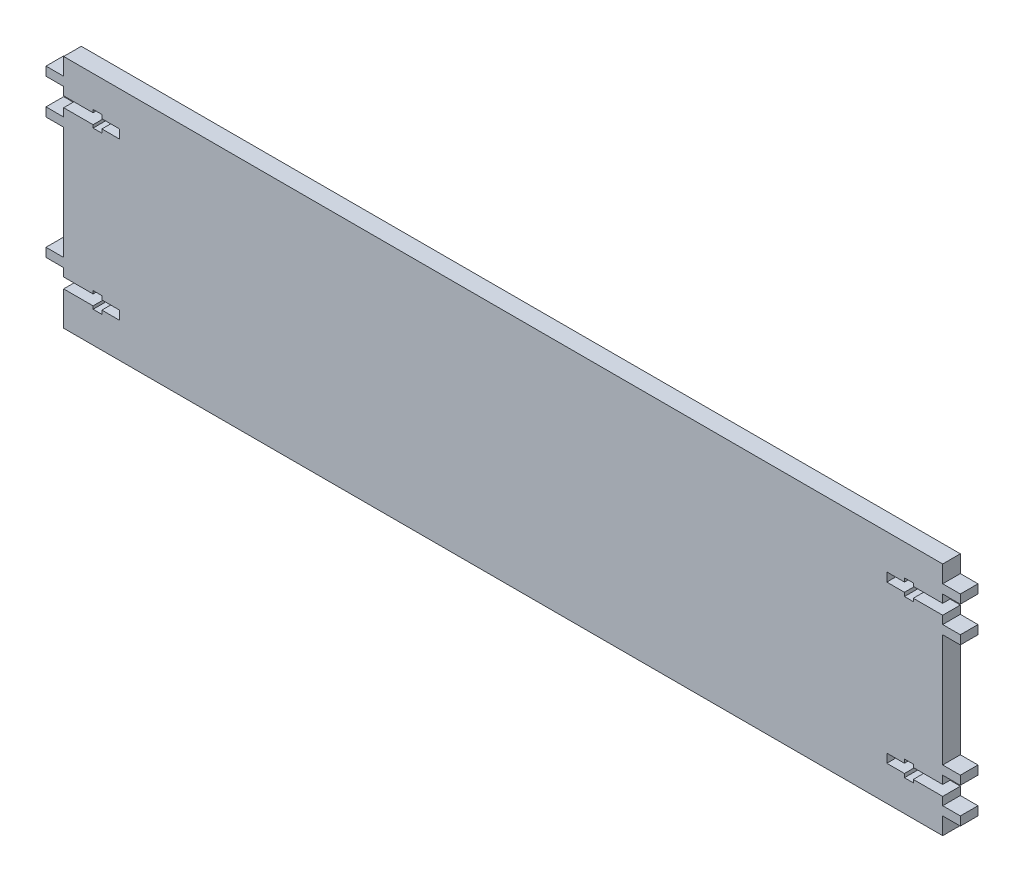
from build123d import *

# Parameters (mm, degrees)
SKETCH1_W           = 298.8
SKETCH1_H           = 80
BOSS_EXTRUDE1_DEPTH = 3
SKETCH2_W           = 6
SKETCH2_H           = 3
BOSS_EXTRUDE3_DEPTH = 6
CUT_EXTRUDE1_DEPTH  = 161.577582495
CUT_EXTRUDE3_DEPTH  = 0.1


with BuildPart() as part:
    # Sketch1 → Boss-Extrude1 (new, symmetric)
    with BuildSketch(Plane.XY):
        Rectangle(SKETCH1_W, SKETCH1_H)
    extrude(amount=BOSS_EXTRUDE1_DEPTH, both=True)

    # Sketch2 → Boss-Extrude3 (add)
    with BuildSketch(Plane.XY.offset(3)):
        with Locations((-152.4, 32.666666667)):
            Rectangle(SKETCH2_W, SKETCH2_H)
        with Locations((-152.4, 20.666666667)):
            Rectangle(SKETCH2_W, SKETCH2_H)
        with Locations((-152.4, -20.666666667)):
            Rectangle(SKETCH2_W, SKETCH2_H)
        with Locations((152.4, 32.666666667)):
            Rectangle(SKETCH2_W, SKETCH2_H)
        with Locations((152.4, 20.666666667)):
            Rectangle(SKETCH2_W, SKETCH2_H)
        with Locations((152.4, -20.666666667)):
            Rectangle(SKETCH2_W, SKETCH2_H)
        with Locations((152.4, -32.666666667)):
            Rectangle(SKETCH2_W, SKETCH2_H)
    extrude(amount=-BOSS_EXTRUDE3_DEPTH)

    # Sketch4 → Cut-Extrude1 (cut, through all)
    with BuildSketch(Plane.XY.offset(3)):
        Polygon((139.4, 24.916666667), (139.4, 23.910766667), (136.4, 23.910766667), (136.4, 25.166666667), (130.4, 25.166666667), (130.4, 28.166666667), (136.4, 28.166666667), (136.4, 29.422566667), (139.4, 29.422566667), (139.4, 28.416666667), (149.4, 28.416666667), (149.4, 24.916666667), align=None)
        Polygon((136.4, -29.422566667), (136.4, -28.166666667), (130.4, -28.166666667), (130.4, -25.166666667), (136.4, -25.166666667), (136.4, -23.910766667), (139.4, -23.910766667), (139.4, -24.916666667), (149.4, -24.916666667), (149.4, -28.416666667), (139.4, -28.416666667), (139.4, -29.422566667), align=None)
        Polygon((-136.4, -29.422566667), (-139.4, -29.422566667), (-139.4, -28.416666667), (-149.4, -28.416666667), (-149.4, -24.916666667), (-139.4, -24.916666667), (-139.4, -23.910766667), (-136.4, -23.910766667), (-136.4, -25.166666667), (-130.4, -25.166666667), (-130.4, -28.166666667), (-136.4, -28.166666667), align=None)
        Polygon((-136.4, 29.422566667), (-136.4, 28.166666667), (-130.4, 28.166666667), (-130.4, 25.166666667), (-136.4, 25.166666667), (-136.4, 23.910766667), (-139.4, 23.910766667), (-139.4, 24.916666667), (-149.4, 24.916666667), (-149.4, 28.416666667), (-139.4, 28.416666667), (-139.4, 29.422566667), align=None)
    extrude(amount=-CUT_EXTRUDE1_DEPTH, mode=Mode.SUBTRACT)

    # Sketch6 → Cut-Extrude3 (cut)
    # profile 1 of 28: a face of its own
    with BuildSketch(Plane(origin=(0, 0, -3), x_dir=(-1, 0, 0), z_dir=(0, 0, -1))):
        with BuildLine():
            add(Edge.make_bspline(
                [(-114.386999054, -27.566165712), (-114.756107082, -28.469356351), (-115.392175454, -29.179343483), (-116.357302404, -29.502194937)],
                knots=[7, 7, 7, 7, 8, 8, 8, 8], degree=3))
            add(Edge.make_bspline(
                [(-116.357302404, -29.502194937), (-117.344559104, -29.832171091), (-118.132567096, -29.356732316), (-118.330898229, -28.33652388)],
                knots=[8, 8, 8, 8, 9, 9, 9, 9], degree=3))
            add(Edge.make_bspline(
                [(-118.330898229, -28.33652388), (-118.615535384, -26.873018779), (-117.471994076, -24.860963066), (-116.043275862, -24.458906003)],
                knots=[9, 9, 9, 9, 10, 10, 10, 10], degree=3))
            add(Edge.make_bspline(
                [(-116.043275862, -24.458906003), (-115.630959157, -24.342940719), (-115.107671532, -24.425036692), (-114.690608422, -24.572766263)],
                knots=[10, 10, 10, 10, 11, 11, 11, 11], degree=3))
            add(Edge.make_bspline(
                [(-114.690608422, -24.572766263), (-114.169046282, -24.757117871), (-113.072950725, -24.222252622), (-113.051981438, -23.661938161)],
                knots=[11, 11, 11, 11, 12, 12, 12, 12], degree=3))
            add(Edge.make_bspline(
                [(-113.051981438, -23.661938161), (-113.036706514, -23.252375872), (-113.015629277, -22.838333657), (-113.057513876, -22.432603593)],
                knots=[12, 12, 12, 12, 13, 13, 13, 13], degree=3))
            add(Edge.make_bspline(
                [(-113.057513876, -22.432603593), (-113.113135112, -21.894823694), (-112.936690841, -21.56171699), (-112.326449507, -21.450744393)],
                knots=[13, 13, 13, 13, 14, 14, 14, 14], degree=3))
            add(Edge.make_bspline(
                [(-112.326449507, -21.450744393), (-111.142831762, -23.883721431), (-111.058495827, -26.34592593), (-112.299030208, -28.770860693)],
                knots=[0, 0, 0, 0, 1, 1, 1, 1], degree=3))
            add(Edge.make_bspline(
                [(-112.299030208, -28.770860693), (-113.700329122, -31.510442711), (-116.020606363, -32.923076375), (-119.088464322, -33.188201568)],
                knots=[1, 1, 1, 1, 2, 2, 2, 2], degree=3))
            add(Edge.make_bspline(
                [(-119.088464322, -33.188201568), (-119.290734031, -32.662700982), (-119.15895567, -32.350131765), (-118.669159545, -32.078664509)],
                knots=[2, 2, 2, 2, 3, 3, 3, 3], degree=3))
            add(Edge.make_bspline(
                [(-118.669159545, -32.078664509), (-116.971510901, -31.137799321), (-115.307704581, -30.134970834), (-113.607681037, -29.19858557)],
                knots=[3, 3, 3, 3, 4, 4, 4, 4], degree=3))
            add(Edge.make_bspline(
                [(-113.607681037, -29.19858557), (-113.159769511, -28.951649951), (-113.002189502, -28.670440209), (-113.039594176, -28.178916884)],
                knots=[4, 4, 4, 4, 5, 5, 5, 5], degree=3))
            add(Edge.make_bspline(
                [(-113.039594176, -28.178916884), (-113.081505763, -27.629937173), (-113.049228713, -27.074912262), (-113.049228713, -26.442649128)],
                knots=[5, 5, 5, 5, 6, 6, 6, 6], degree=3))
            add(Edge.make_bspline(
                [(-113.049228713, -26.442649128), (-113.674502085, -26.712793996), (-114.135311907, -26.949987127), (-114.386999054, -27.566165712)],
                knots=[6, 6, 6, 6, 7, 7, 7, 7], degree=3))
        make_face()
    # profile 2 of 28: a face of its own
    with BuildSketch(Plane(origin=(0, 0, -3), x_dir=(-1, 0, 0), z_dir=(0, 0, -1))):
        with BuildLine():
            add(Edge.make_bspline(
                [(-113.910236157, -20.992304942), (-115.608829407, -19.970776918), (-117.334140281, -18.992480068), (-119.06765696, -18.030807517)],
                knots=[2, 2, 2, 2, 3, 3, 3, 3], degree=3))
            add(Edge.make_bspline(
                [(-119.06765696, -18.030807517), (-119.276648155, -17.914842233), (-119.640331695, -17.909687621), (-119.858820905, -18.011295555)],
                knots=[3, 3, 3, 3, 4, 4, 4, 4], degree=3))
            add(Edge.make_bspline(
                [(-119.858820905, -18.011295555), (-120.4365169, -18.280118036), (-120.973891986, -18.635921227), (-121.588775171, -18.992615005)],
                knots=[4, 4, 4, 4, 5, 5, 5, 5], degree=3))
            add(Edge.make_bspline(
                [(-121.588775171, -18.992615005), (-121.094742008, -19.379507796), (-120.663697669, -19.576516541), (-120.073481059, -19.492315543)],
                knots=[5, 5, 5, 5, 6, 6, 6, 6], degree=3))
            add(Edge.make_bspline(
                [(-120.073481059, -19.492315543), (-119.176362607, -19.364232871), (-118.304801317, -19.522217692), (-117.549070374, -20.066852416)],
                knots=[6, 6, 6, 6, 7, 7, 7, 7], degree=3))
            add(Edge.make_bspline(
                [(-117.549070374, -20.066852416), (-116.569451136, -20.772896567), (-116.572878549, -21.882193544), (-117.542350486, -22.603002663)],
                knots=[7, 7, 7, 7, 8, 8, 8, 8], degree=3))
            add(Edge.make_bspline(
                [(-117.542350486, -22.603002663), (-118.66413987, -23.436997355), (-120.738291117, -23.464416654), (-121.794204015, -22.558311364)],
                knots=[8, 8, 8, 8, 9, 9, 9, 9], degree=3))
            add(Edge.make_bspline(
                [(-121.794204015, -22.558311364), (-122.144987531, -22.257209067), (-122.371115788, -21.725908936), (-122.487081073, -21.25835051)],
                knots=[9, 9, 9, 9, 10, 10, 10, 10], degree=3))
            add(Edge.make_bspline(
                [(-122.487081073, -21.25835051), (-122.619508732, -20.723890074), (-123.525182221, -20.123526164), (-124.015410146, -20.38614152)],
                knots=[10, 10, 10, 10, 11, 11, 11, 11], degree=3))
            add(Edge.make_bspline(
                [(-124.015410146, -20.38614152), (-124.357233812, -20.569305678), (-124.714467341, -20.736412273), (-125.022286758, -20.967128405)],
                knots=[11, 11, 11, 11, 12, 12, 12, 12], degree=3))
            add(Edge.make_bspline(
                [(-125.022286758, -20.967128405), (-125.477295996, -21.308304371), (-125.868290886, -21.312646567), (-126.246736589, -20.875829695)],
                knots=[12, 12, 12, 12, 13, 13, 13, 13], degree=3))
            add(Edge.make_bspline(
                [(-126.246736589, -20.875829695), (-123.329387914, -16.010550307), (-115.888583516, -15.783504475), (-112.706217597, -20.85526522)],
                knots=[0, 0, 0, 0, 1, 1, 1, 1], degree=3))
            add(Edge.make_bspline(
                [(-112.706217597, -20.85526522), (-113.064503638, -21.287092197), (-113.414639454, -21.290384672), (-113.910236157, -20.992304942)],
                knots=[1, 1, 1, 1, 2, 2, 2, 2], degree=3))
        make_face()
    # profile 3 of 28: a face of its own
    with BuildSketch(Plane(origin=(0, 0, -3), x_dir=(-1, 0, 0), z_dir=(0, 0, -1))):
        with BuildLine():
            add(Edge.make_bspline(
                [(-120.642485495, -28.568184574), (-120.706391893, -28.788240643), (-120.812479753, -29.059438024), (-120.986549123, -29.17329569)],
                knots=[10, 10, 10, 10, 11, 11, 11, 11], degree=3))
            add(Edge.make_bspline(
                [(-120.986549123, -29.17329569), (-121.845993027, -29.736230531), (-121.517609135, -30.594352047), (-121.415083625, -31.283531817)],
                knots=[11, 11, 11, 11, 12, 12, 12, 12], degree=3))
            add(Edge.make_bspline(
                [(-121.415083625, -31.283531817), (-121.365802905, -31.615343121), (-120.705204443, -31.890750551), (-120.283524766, -32.12268112)],
                knots=[12, 12, 12, 12, 13, 13, 13, 13], degree=3))
            add(Edge.make_bspline(
                [(-120.283524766, -32.12268112), (-119.882814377, -32.343007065), (-119.693443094, -32.591532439), (-119.915091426, -33.127587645)],
                knots=[13, 13, 13, 13, 14, 14, 14, 14], degree=3))
            add(Edge.make_bspline(
                [(-119.915091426, -33.127587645), (-122.710294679, -32.915438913), (-124.889589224, -31.68097419), (-126.32778005, -29.300841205)],
                knots=[0, 0, 0, 0, 1, 1, 1, 1], degree=3))
            add(Edge.make_bspline(
                [(-126.32778005, -29.300841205), (-127.849524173, -26.782367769), (-127.840699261, -24.158208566), (-126.629932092, -21.493438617)],
                knots=[1, 1, 1, 1, 2, 2, 2, 2], degree=3))
            add(Edge.make_bspline(
                [(-126.629932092, -21.493438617), (-126.073072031, -21.590701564), (-125.92599016, -21.886538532), (-125.933789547, -22.400839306)],
                knots=[2, 2, 2, 2, 3, 3, 3, 3], degree=3))
            add(Edge.make_bspline(
                [(-125.933789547, -22.400839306), (-125.962639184, -24.321213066), (-125.925071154, -26.242347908), (-125.958294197, -28.162589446)],
                knots=[3, 3, 3, 3, 4, 4, 4, 4], degree=3))
            add(Edge.make_bspline(
                [(-125.958294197, -28.162589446), (-125.967901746, -28.712079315), (-125.810564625, -29.043623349), (-125.300850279, -29.264219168)],
                knots=[4, 4, 4, 4, 5, 5, 5, 5], degree=3))
            add(Edge.make_bspline(
                [(-125.300850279, -29.264219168), (-124.85520715, -29.457395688), (-124.44564486, -29.733855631), (-123.914072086, -30.033524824)],
                knots=[5, 5, 5, 5, 6, 6, 6, 6], degree=3))
            add(Edge.make_bspline(
                [(-123.914072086, -30.033524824), (-123.929885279, -29.268699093), (-123.832623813, -28.669657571), (-124.186564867, -28.012080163)],
                knots=[6, 6, 6, 6, 7, 7, 7, 7], degree=3))
            add(Edge.make_bspline(
                [(-124.186564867, -28.012080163), (-124.53867077, -27.35822703), (-124.772058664, -26.55702215), (-124.776538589, -25.818563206)],
                knots=[7, 7, 7, 7, 8, 8, 8, 8], degree=3))
            add(Edge.make_bspline(
                [(-124.776538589, -25.818563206), (-124.783906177, -24.649329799), (-123.836321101, -24.120239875), (-122.734286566, -24.524134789)],
                knots=[8, 8, 8, 8, 9, 9, 9, 9], degree=3))
            add(Edge.make_bspline(
                [(-122.734286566, -24.524134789), (-121.303085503, -25.048744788), (-120.221993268, -27.121816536), (-120.642485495, -28.568184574)],
                knots=[9, 9, 9, 9, 10, 10, 10, 10], degree=3))
        make_face()
    # profile 4 of 28: a face of its own
    with BuildSketch(Plane(origin=(0, 0, -3), x_dir=(-1, 0, 0), z_dir=(0, 0, -1))):
        with BuildLine():
            Line((31.510796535, 3.517951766), (31.510796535, 3.274522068))
            add(Edge.make_bspline(
                [(31.510796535, 3.274522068), (31.515347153, 3.179510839), (31.524107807, 2.996599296), (31.613237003, 2.836916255), (31.656069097, 2.760178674)],
                knots=[0, 0, 0, 0, 1.038876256, 2, 2, 2, 2], degree=3))
            add(Edge.make_bspline(
                [(31.656069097, 2.760178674), (31.715923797, 2.682334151), (31.834696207, 2.527863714), (32.095328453, 2.372846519), (32.400423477, 2.276265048), (32.622396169, 2.266632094), (32.739723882, 2.261540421)],
                knots=[0, 0, 0, 0, 0.939783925, 1.864856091, 2.871430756, 4, 4, 4, 4], degree=3))
            add(Edge.make_bspline(
                [(32.739723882, 2.261540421), (32.881961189, 2.269079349), (33.175334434, 2.284628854), (33.616567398, 2.419758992), (34.075821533, 2.615575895), (34.546727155, 2.901064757), (35.035960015, 3.260480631), (35.535012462, 3.705722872), (36.06109462, 4.218122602), (36.396603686, 4.604197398), (36.571778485, 4.805773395)],
                knots=[0, 0, 0, 0, 0.720683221, 1.486453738, 2.325776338, 3.252235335, 4.274225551, 5.404349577, 6.644768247, 8, 8, 8, 8], degree=3))
            add(Edge.make_bspline(
                [(36.571778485, 4.805773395), (36.63174867, 4.871567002), (36.740689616, 4.991086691), (36.910385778, 5.131873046), (37.0673766, 5.224032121), (37.172998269, 5.238938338), (37.219615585, 5.245517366)],
                knots=[0, 0, 0, 0, 1.329936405, 2.415942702, 3.30085843, 4, 4, 4, 4], degree=3))
            add(Edge.make_bspline(
                [(37.219615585, 5.245517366), (37.269193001, 5.238445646), (37.375579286, 5.223270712), (37.44795521, 5.143070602), (37.486602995, 5.100244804)],
                knots=[0, 0, 0, 0, 0.932026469, 2, 2, 2, 2], degree=3))
            add(Edge.make_bspline(
                [(37.486602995, 5.100244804), (37.509459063, 5.067432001), (37.55172827, 5.006749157), (37.560911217, 4.933599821), (37.565128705, 4.900004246)],
                knots=[0, 0, 0, 0, 1.081452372, 2, 2, 2, 2], degree=3))
            add(Edge.make_bspline(
                [(37.565128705, 4.900004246), (37.560612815, 4.852452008), (37.550672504, 4.747780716), (37.484791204, 4.583447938), (37.379700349, 4.401142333), (37.241904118, 4.190523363), (37.059857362, 3.962573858), (36.842427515, 3.708636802), (36.583598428, 3.43551319), (36.393178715, 3.250257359), (36.293012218, 3.152807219)],
                knots=[0, 0, 0, 0, 0.519768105, 1.144105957, 1.912229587, 2.820522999, 3.890404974, 5.097186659, 6.473032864, 8, 8, 8, 8], degree=3))
            add(Edge.make_bspline(
                [(36.293012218, 3.152807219), (36.125929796, 2.997719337), (35.796429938, 2.691873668), (35.277002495, 2.271831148), (34.735387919, 1.906755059), (34.35889109, 1.697493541), (34.172818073, 1.594071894)],
                knots=[0, 0, 0, 0, 1.035913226, 2.042903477, 3.032759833, 4, 4, 4, 4], degree=3))
            add(Edge.make_bspline(
                [(34.172818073, 1.594071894), (33.990279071, 1.502837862), (33.63940434, 1.327468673), (33.100378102, 1.151823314), (32.585982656, 1.024463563), (32.245728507, 1.01145908), (32.080107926, 1.005129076)],
                knots=[0, 0, 0, 0, 1.114469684, 2.14222302, 3.095716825, 4, 4, 4, 4], degree=3))
            add(Edge.make_bspline(
                [(32.080107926, 1.005129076), (31.928264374, 1.011852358), (31.637593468, 1.024722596), (31.231436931, 1.167803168), (30.872849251, 1.387118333), (30.69421142, 1.600146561), (30.603824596, 1.707934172)],
                knots=[0, 0, 0, 0, 1.06896785, 2.046302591, 3.011471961, 4, 4, 4, 4], degree=3))
            add(Edge.make_bspline(
                [(30.603824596, 1.707934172), (30.549335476, 1.795199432), (30.436586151, 1.975769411), (30.329533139, 2.292855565), (30.268182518, 2.650424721), (30.259137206, 2.90255847), (30.25438519, 3.035018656)],
                knots=[0, 0, 0, 0, 0.883779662, 1.828723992, 2.859305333, 4, 4, 4, 4], degree=3))
            add(Edge.make_bspline(
                [(30.25438519, 3.035018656), (30.260536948, 3.225158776), (30.272914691, 3.607733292), (30.370682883, 4.177956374), (30.529757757, 4.744536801), (30.750808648, 5.307471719), (31.037026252, 5.867396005), (31.382686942, 6.42488916), (31.794239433, 6.977695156), (32.10495849, 7.329952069), (32.264643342, 7.510984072)],
                knots=[0, 0, 0, 0, 0.908113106, 1.827183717, 2.755736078, 3.716086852, 4.711684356, 5.756347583, 6.846941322, 8, 8, 8, 8], degree=3))
            add(Edge.make_bspline(
                [(32.264643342, 7.510984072), (32.39635081, 7.652776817), (32.648468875, 7.924200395), (33.039010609, 8.286538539), (33.415269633, 8.593733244), (33.777203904, 8.848588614), (34.127805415, 9.047573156), (34.465519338, 9.1913291), (34.792569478, 9.280079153), (35.007320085, 9.291782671), (35.111200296, 9.297443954)],
                knots=[0, 0, 0, 0, 1.346932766, 2.578335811, 3.70536743, 4.726507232, 5.656640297, 6.506114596, 7.277370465, 8, 8, 8, 8], degree=3))
            add(Edge.make_bspline(
                [(35.111200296, 9.297443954), (35.165223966, 9.295937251), (35.272498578, 9.292945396), (35.42567836, 9.245914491), (35.573592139, 9.179055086), (35.659471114, 9.112259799), (35.7040694, 9.077571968)],
                knots=[0, 0, 0, 0, 0.999899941, 1.985497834, 2.953837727, 4, 4, 4, 4], degree=3))
            add(Edge.make_bspline(
                [(35.7040694, 9.077571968), (35.755336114, 9.028822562), (35.856164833, 8.932944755), (35.958305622, 8.748548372), (36.025018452, 8.544282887), (36.030858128, 8.398894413), (36.033877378, 8.323725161)],
                knots=[0, 0, 0, 0, 0.993693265, 1.954344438, 2.942348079, 4, 4, 4, 4], degree=3))
            add(Edge.make_bspline(
                [(36.033877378, 8.323725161), (36.02533266, 8.19472051), (36.007065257, 7.918926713), (35.877487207, 7.491755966), (35.679074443, 7.025145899), (35.500828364, 6.71218957), (35.405671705, 6.545117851)],
                knots=[0, 0, 0, 0, 0.811569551, 1.735021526, 2.790841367, 4, 4, 4, 4], degree=3))
            add(Edge.make_bspline(
                [(35.405671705, 6.545117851), (35.293905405, 6.367364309), (35.072495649, 6.015233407), (34.682295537, 5.531587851), (34.258519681, 5.084099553), (33.788615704, 4.683653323), (33.279464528, 4.323453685), (32.727533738, 4.010286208), (32.136263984, 3.737146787), (31.721519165, 3.591799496), (31.510796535, 3.517951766)],
                knots=[0, 0, 0, 0, 0.997761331, 1.976571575, 2.949427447, 3.92490772, 4.90745069, 5.911018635, 6.938634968, 8, 8, 8, 8], degree=3))
        make_face()
        with BuildLine():
            add(Edge.make_bspline(
                [(31.762078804, 4.523080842), (31.904320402, 4.577269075), (32.176819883, 4.681080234), (32.552539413, 4.862481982), (32.884088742, 5.048259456), (33.076110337, 5.192453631), (33.167688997, 5.261222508)],
                knots=[0, 0, 0, 0, 1.145286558, 2.194083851, 3.138725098, 4, 4, 4, 4], degree=3))
            add(Edge.make_bspline(
                [(33.167688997, 5.261222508), (33.311553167, 5.385533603), (33.594956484, 5.630418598), (33.972565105, 6.040002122), (34.309481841, 6.468330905), (34.493959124, 6.777289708), (34.585078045, 6.929893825)],
                knots=[0, 0, 0, 0, 1.035673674, 2.04021163, 3.032001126, 4, 4, 4, 4], degree=3))
            add(Edge.make_bspline(
                [(34.585078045, 6.929893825), (34.64153184, 7.030767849), (34.743946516, 7.213766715), (34.767083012, 7.421627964), (34.777466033, 7.514910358)],
                knots=[0, 0, 0, 0, 1.102455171, 2, 2, 2, 2], degree=3))
            add(Edge.make_bspline(
                [(34.777466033, 7.514910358), (34.774948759, 7.555825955), (34.770450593, 7.62893884), (34.726878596, 7.72857407), (34.63754767, 7.783831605), (34.570053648, 7.787690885), (34.534036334, 7.78975034)],
                knots=[0, 0, 0, 0, 1.168462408, 2.08794847, 2.979658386, 4, 4, 4, 4], degree=3))
            add(Edge.make_bspline(
                [(34.534036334, 7.78975034), (34.47149728, 7.782758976), (34.32915671, 7.766846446), (34.112651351, 7.64696635), (33.854898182, 7.484327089), (33.682775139, 7.33704335), (33.58780154, 7.255775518)],
                knots=[0, 0, 0, 0, 0.678255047, 1.543726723, 2.644684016, 4, 4, 4, 4], degree=3))
            add(Edge.make_bspline(
                [(33.58780154, 7.255775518), (33.495905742, 7.174955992), (33.310058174, 7.011508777), (33.056164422, 6.731428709), (32.807046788, 6.431598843), (32.577909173, 6.098445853), (32.352174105, 5.745297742), (32.14002989, 5.364283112), (31.944462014, 4.953643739), (31.823815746, 4.668826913), (31.762078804, 4.523080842)],
                knots=[0, 0, 0, 0, 0.884611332, 1.789013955, 2.730944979, 3.702805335, 4.711417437, 5.762504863, 6.855032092, 8, 8, 8, 8], degree=3))
        make_face(mode=Mode.SUBTRACT)
    # profile 5 of 28: a face of its own
    with BuildSketch(Plane(origin=(0, 0, -3), x_dir=(-1, 0, 0), z_dir=(0, 0, -1))):
        with BuildLine():
            add(Edge.make_bspline(
                [(28.717637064, 9.800008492), (28.84619592, 9.796870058), (29.087835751, 9.790971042), (29.423190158, 9.731916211), (29.71171954, 9.640548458), (29.946538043, 9.50113696), (30.137827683, 9.325418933), (30.263035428, 9.099175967), (30.34619301, 8.837303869), (30.3518881, 8.647722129), (30.354898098, 8.547523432)],
                knots=[0, 0, 0, 0, 1.30941663, 2.461185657, 3.461276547, 4.376681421, 5.226100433, 6.075204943, 6.982697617, 8, 8, 8, 8], degree=3))
            add(Edge.make_bspline(
                [(30.354898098, 8.547523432), (30.348226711, 8.409370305), (30.334875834, 8.132896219), (30.220520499, 7.723219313), (30.041309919, 7.320371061), (29.869702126, 7.072676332), (29.781660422, 6.945598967)],
                knots=[0, 0, 0, 0, 0.956575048, 1.914312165, 2.929958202, 4, 4, 4, 4], degree=3))
            add(Edge.make_bspline(
                [(29.781660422, 6.945598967), (29.681587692, 6.82717459), (29.475767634, 6.58361061), (29.092317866, 6.270783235), (28.642609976, 5.992843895), (28.310024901, 5.844887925), (28.136546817, 5.767713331)],
                knots=[0, 0, 0, 0, 0.907796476, 1.867069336, 2.887452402, 4, 4, 4, 4], degree=3))
            add(Edge.make_bspline(
                [(28.136546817, 5.767713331), (28.041552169, 5.730793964), (27.861560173, 5.660840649), (27.597581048, 5.585698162), (27.358093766, 5.539992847), (27.206177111, 5.531956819), (27.135344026, 5.528209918)],
                knots=[0, 0, 0, 0, 1.181048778, 2.237803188, 3.178353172, 4, 4, 4, 4], degree=3))
            add(Edge.make_bspline(
                [(27.135344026, 5.528209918), (27.054332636, 5.532489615), (26.907324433, 5.540255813), (26.715104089, 5.638112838), (26.600186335, 5.813378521), (26.590775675, 5.949165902), (26.585664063, 6.022921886)],
                knots=[0, 0, 0, 0, 1.148630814, 2.084375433, 2.959485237, 4, 4, 4, 4], degree=3))
            add(Edge.make_bspline(
                [(26.585664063, 6.022921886), (26.588974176, 6.075960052), (26.595519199, 6.180831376), (26.661355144, 6.32413882), (26.766518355, 6.446393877), (26.85851659, 6.503082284), (26.90761947, 6.533338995)],
                knots=[0, 0, 0, 0, 0.996421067, 1.970203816, 2.916622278, 4, 4, 4, 4], degree=3))
            add(Edge.make_bspline(
                [(26.90761947, 6.533338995), (26.936292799, 6.544176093), (27.024696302, 6.577588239), (27.208137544, 6.623436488), (27.484859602, 6.689876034), (27.699434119, 6.742610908), (27.82244398, 6.772842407)],
                knots=[0, 0, 0, 0, 0.388567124, 1.198001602, 2.393688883, 4, 4, 4, 4], degree=3))
            add(Edge.make_bspline(
                [(27.82244398, 6.772842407), (27.904412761, 6.79540504), (28.068399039, 6.840543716), (28.301912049, 6.950880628), (28.529352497, 7.087740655), (28.66678012, 7.203998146), (28.737268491, 7.263628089)],
                knots=[0, 0, 0, 0, 0.971283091, 1.943143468, 2.94501219, 4, 4, 4, 4], degree=3))
            add(Edge.make_bspline(
                [(28.737268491, 7.263628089), (28.791717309, 7.316761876), (28.895636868, 7.4181716), (29.012505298, 7.59343166), (29.083372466, 7.77804831), (29.093506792, 7.904362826), (29.098486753, 7.966433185)],
                knots=[0, 0, 0, 0, 1.120126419, 2.137843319, 3.084944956, 4, 4, 4, 4], degree=3))
            add(Edge.make_bspline(
                [(29.098486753, 7.966433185), (29.093875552, 8.053815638), (29.085335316, 8.215653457), (28.943501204, 8.420092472), (28.713601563, 8.530692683), (28.539630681, 8.5389828), (28.442797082, 8.543597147)],
                knots=[0, 0, 0, 0, 1.035889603, 1.918532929, 2.841438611, 4, 4, 4, 4], degree=3))
            add(Edge.make_bspline(
                [(28.442797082, 8.543597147), (28.305967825, 8.535209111), (28.021423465, 8.517765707), (27.587845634, 8.394236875), (27.135300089, 8.201689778), (26.841437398, 8.024018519), (26.687747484, 7.931096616)],
                knots=[0, 0, 0, 0, 0.871873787, 1.813112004, 2.856259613, 4, 4, 4, 4], degree=3))
            add(Edge.make_bspline(
                [(26.687747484, 7.931096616), (26.600097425, 7.873928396), (26.431384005, 7.763888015), (26.20714153, 7.576422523), (26.010304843, 7.38675539), (25.859111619, 7.17917336), (25.731553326, 6.969936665), (25.648278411, 6.748459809), (25.586804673, 6.520943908), (25.582641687, 6.364933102), (25.580534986, 6.285983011)],
                knots=[0, 0, 0, 0, 1.209290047, 2.32770476, 3.376757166, 4.360767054, 5.290282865, 6.201119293, 7.089666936, 8, 8, 8, 8], degree=3))
            add(Edge.make_bspline(
                [(25.580534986, 6.285983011), (25.589439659, 6.164422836), (25.608708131, 5.901383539), (25.766193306, 5.498190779), (25.98229502, 5.046608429), (26.185766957, 4.749501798), (26.295118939, 4.589827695)],
                knots=[0, 0, 0, 0, 0.780136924, 1.688107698, 2.757519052, 4, 4, 4, 4], degree=3))
            add(Edge.make_bspline(
                [(26.295118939, 4.589827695), (26.413856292, 4.414021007), (26.635530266, 4.085802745), (26.893568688, 3.594500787), (27.05027717, 3.138564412), (27.076232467, 2.844875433), (27.088228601, 2.709136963)],
                knots=[0, 0, 0, 0, 1.229410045, 2.295218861, 3.212076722, 4, 4, 4, 4], degree=3))
            add(Edge.make_bspline(
                [(27.088228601, 2.709136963), (27.085644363, 2.615952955), (27.080544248, 2.432049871), (27.027400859, 2.165636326), (26.945860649, 1.91348011), (26.8243477, 1.680251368), (26.67664776, 1.459191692), (26.49070912, 1.256978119), (26.275944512, 1.066118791), (26.109633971, 0.960979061), (26.024205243, 0.90697194)],
                knots=[0, 0, 0, 0, 1.016981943, 2.007062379, 2.956761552, 3.90333298, 4.871163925, 5.853363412, 6.897337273, 8, 8, 8, 8], degree=3))
            add(Edge.make_bspline(
                [(26.024205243, 0.90697194), (25.913361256, 0.844328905), (25.691279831, 0.718820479), (25.323800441, 0.597123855), (24.937838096, 0.513207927), (24.671420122, 0.506148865), (24.536143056, 0.502564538)],
                knots=[0, 0, 0, 0, 0.976322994, 1.95611153, 2.962190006, 4, 4, 4, 4], degree=3))
            add(Edge.make_bspline(
                [(24.536143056, 0.502564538), (24.429972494, 0.505673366), (24.223269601, 0.511725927), (23.923353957, 0.555980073), (23.642039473, 0.625274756), (23.380225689, 0.727662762), (23.141045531, 0.86326448), (22.917291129, 1.020750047), (22.714525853, 1.210762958), (22.599888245, 1.358144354), (22.541590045, 1.433094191)],
                knots=[0, 0, 0, 0, 1.11240044, 2.165726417, 3.170416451, 4.143426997, 5.101334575, 6.045293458, 7.005946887, 8, 8, 8, 8], degree=3))
            add(Edge.make_bspline(
                [(22.541590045, 1.433094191), (22.468008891, 1.544696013), (22.320524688, 1.768387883), (22.174365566, 2.147822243), (22.080117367, 2.552697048), (22.068513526, 2.83291503), (22.06258322, 2.976124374)],
                knots=[0, 0, 0, 0, 0.974751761, 1.953767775, 2.954244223, 4, 4, 4, 4], degree=3))
            add(Edge.make_bspline(
                [(22.06258322, 2.976124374), (22.068406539, 3.143076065), (22.079687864, 3.466506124), (22.194429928, 3.928068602), (22.373451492, 4.351223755), (22.551004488, 4.59408463), (22.639747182, 4.71546883)],
                knots=[0, 0, 0, 0, 1.070283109, 2.073424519, 3.037079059, 4, 4, 4, 4], degree=3))
            add(Edge.make_bspline(
                [(22.639747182, 4.71546883), (22.700121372, 4.786050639), (22.812878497, 4.9178719), (23.008419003, 5.066815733), (23.208795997, 5.162132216), (23.346894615, 5.173371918), (23.413225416, 5.178770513)],
                knots=[0, 0, 0, 0, 1.192968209, 2.228032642, 3.148897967, 4, 4, 4, 4], degree=3))
            add(Edge.make_bspline(
                [(23.413225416, 5.178770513), (23.462352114, 5.177254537), (23.549851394, 5.17455444), (23.662852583, 5.121287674), (23.736417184, 5.028346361), (23.740726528, 4.95242507), (23.743033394, 4.911783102)],
                knots=[0, 0, 0, 0, 1.209289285, 2.15385825, 3.011728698, 4, 4, 4, 4], degree=3))
            add(Edge.make_bspline(
                [(23.743033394, 4.911783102), (23.736027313, 4.866549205), (23.718460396, 4.753130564), (23.660243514, 4.653593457), (23.625244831, 4.593753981)],
                knots=[0, 0, 0, 0, 0.797644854, 2, 2, 2, 2], degree=3))
            add(Edge.make_bspline(
                [(23.625244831, 4.593753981), (23.577714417, 4.495466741), (23.481408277, 4.296317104), (23.3912544, 3.969585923), (23.328774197, 3.621133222), (23.322322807, 3.37953173), (23.318994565, 3.254890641)],
                knots=[0, 0, 0, 0, 0.943174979, 1.911061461, 2.922326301, 4, 4, 4, 4], degree=3))
            add(Edge.make_bspline(
                [(23.318994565, 3.254890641), (23.325381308, 3.150884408), (23.337900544, 2.94701233), (23.426977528, 2.652829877), (23.57896056, 2.383259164), (23.721233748, 2.232643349), (23.794075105, 2.155530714)],
                knots=[0, 0, 0, 0, 1.01318953, 1.986044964, 2.968890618, 4, 4, 4, 4], degree=3))
            add(Edge.make_bspline(
                [(23.794075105, 2.155530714), (23.865469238, 2.095310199), (24.004148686, 1.978334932), (24.241581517, 1.849128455), (24.495969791, 1.771609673), (24.671729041, 1.763197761), (24.759941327, 1.758975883)],
                knots=[0, 0, 0, 0, 1.045915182, 2.031636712, 3.012092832, 4, 4, 4, 4], degree=3))
            add(Edge.make_bspline(
                [(24.759941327, 1.758975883), (24.844339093, 1.761453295), (25.005678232, 1.766189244), (25.230403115, 1.837989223), (25.431047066, 1.942948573), (25.535726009, 2.047809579), (25.588387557, 2.100562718)],
                knots=[0, 0, 0, 0, 1.09126884, 2.086126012, 3.037174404, 4, 4, 4, 4], degree=3))
            add(Edge.make_bspline(
                [(25.588387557, 2.100562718), (25.625462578, 2.151805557), (25.699668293, 2.254368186), (25.781238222, 2.431658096), (25.822226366, 2.63136183), (25.828542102, 2.770485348), (25.831817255, 2.842630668)],
                knots=[0, 0, 0, 0, 0.951244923, 1.903918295, 2.913034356, 4, 4, 4, 4], degree=3))
            add(Edge.make_bspline(
                [(25.831817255, 2.842630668), (25.822922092, 2.942975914), (25.803457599, 3.162552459), (25.67170555, 3.504703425), (25.469733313, 3.88539168), (25.291775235, 4.141480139), (25.195759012, 4.279651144)],
                knots=[0, 0, 0, 0, 0.755704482, 1.653640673, 2.734035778, 4, 4, 4, 4], degree=3))
            add(Edge.make_bspline(
                [(25.195759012, 4.279651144), (25.063057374, 4.473977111), (24.811622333, 4.842174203), (24.542818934, 5.414863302), (24.358945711, 5.956768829), (24.33539799, 6.314801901), (24.324123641, 6.486223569)],
                knots=[0, 0, 0, 0, 1.170833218, 2.218423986, 3.147004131, 4, 4, 4, 4], degree=3))
            add(Edge.make_bspline(
                [(24.324123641, 6.486223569), (24.32876249, 6.595228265), (24.337960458, 6.811364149), (24.408720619, 7.129367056), (24.517561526, 7.440493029), (24.682448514, 7.73694494), (24.884371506, 8.028189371), (25.133791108, 8.305703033), (25.426790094, 8.575605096), (25.646915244, 8.73806078), (25.761144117, 8.822363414)],
                knots=[0, 0, 0, 0, 0.915590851, 1.815445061, 2.72725999, 3.677369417, 4.657148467, 5.701517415, 6.807255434, 8, 8, 8, 8], degree=3))
            add(Edge.make_bspline(
                [(25.761144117, 8.822363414), (25.8779987, 8.899770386), (26.108703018, 9.052593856), (26.466408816, 9.252890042), (26.82931965, 9.42377216), (27.197531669, 9.559872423), (27.569849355, 9.668475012), (27.948556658, 9.741186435), (28.331541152, 9.791079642), (28.589222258, 9.797038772), (28.717637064, 9.800008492)],
                knots=[0, 0, 0, 0, 1.063098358, 2.098859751, 3.107178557, 4.103101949, 5.074165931, 6.045838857, 7.026148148, 8, 8, 8, 8], degree=3))
        make_face()
    # profile 6 of 28: a face of its own
    with BuildSketch(Plane(origin=(0, 0, -3), x_dir=(-1, 0, 0), z_dir=(0, 0, -1))):
        with BuildLine():
            add(Edge.make_bspline(
                [(18.299631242, 8.139189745), (18.379331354, 8.186528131), (18.527559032, 8.274568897), (18.733572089, 8.392605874), (18.908782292, 8.483530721), (19.014153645, 8.535869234), (19.061330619, 8.559302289)],
                knots=[0, 0, 0, 0, 1.278359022, 2.377514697, 3.273579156, 4, 4, 4, 4], degree=3))
            add(Edge.make_bspline(
                [(19.061330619, 8.559302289), (19.227896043, 8.627978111), (19.547949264, 8.75993778), (19.893088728, 8.783553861), (20.058607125, 8.794879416)],
                knots=[0, 0, 0, 0, 1.040860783, 2, 2, 2, 2], degree=3))
            add(Edge.make_bspline(
                [(20.058607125, 8.794879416), (20.145427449, 8.791929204), (20.309904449, 8.786340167), (20.539770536, 8.722611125), (20.735480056, 8.615028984), (20.891493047, 8.459318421), (21.016467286, 8.2659363), (21.100980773, 8.028417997), (21.15146149, 7.750022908), (21.155706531, 7.55049012), (21.157967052, 7.44423722)],
                knots=[0, 0, 0, 0, 1.043744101, 1.977323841, 2.845771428, 3.70442851, 4.605478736, 5.598432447, 6.721144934, 8, 8, 8, 8], degree=3))
            add(Edge.make_bspline(
                [(21.157967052, 7.44423722), (21.149728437, 7.282610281), (21.132177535, 6.938292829), (20.99914735, 6.404259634), (20.798199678, 5.823393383), (20.614824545, 5.432382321), (20.517982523, 5.225885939)],
                knots=[0, 0, 0, 0, 0.83294812, 1.774447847, 2.824666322, 4, 4, 4, 4], degree=3))
            add(Edge.make_bspline(
                [(20.517982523, 5.225885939), (20.434383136, 5.058898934), (20.269961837, 4.730472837), (20.001273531, 4.257531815), (19.720754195, 3.81121438), (19.424696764, 3.394046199), (19.119104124, 3.002701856), (18.794697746, 2.642610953), (18.464630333, 2.302584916), (18.227889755, 2.098901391), (18.11116954, 1.998479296)],
                knots=[0, 0, 0, 0, 1.10481091, 2.172916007, 3.217059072, 4.222611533, 5.198626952, 6.152989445, 7.089368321, 8, 8, 8, 8], degree=3))
            add(Edge.make_bspline(
                [(18.11116954, 1.998479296), (18.013913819, 1.920105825), (17.823644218, 1.766777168), (17.531978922, 1.563171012), (17.242604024, 1.39517834), (16.963943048, 1.248338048), (16.682992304, 1.144518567), (16.40924207, 1.064551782), (16.139371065, 1.014536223), (15.961071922, 1.008235), (15.873186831, 1.005129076)],
                knots=[0, 0, 0, 0, 1.200415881, 2.348475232, 3.414260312, 4.415665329, 5.371220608, 6.287031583, 7.155664, 8, 8, 8, 8], degree=3))
            add(Edge.make_bspline(
                [(15.873186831, 1.005129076), (15.777145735, 1.010890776), (15.581978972, 1.022599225), (15.292066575, 1.105182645), (15.004397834, 1.240900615), (14.826967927, 1.367278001), (14.73456405, 1.433094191)],
                knots=[0, 0, 0, 0, 0.930697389, 1.891286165, 2.901801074, 4, 4, 4, 4], degree=3))
            add(Edge.make_bspline(
                [(14.73456405, 1.433094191), (14.424725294, 0.815782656), (13.805693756, -0.417553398), (12.942089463, -2.297627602), (12.116640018, -4.192159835), (11.610789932, -5.473029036), (11.35795856, -6.113226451)],
                knots=[0, 0, 0, 0, 1.002071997, 2.002054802, 3.001397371, 4, 4, 4, 4], degree=3))
            add(Edge.make_bspline(
                [(11.35795856, -6.113226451), (11.310349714, -6.250502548), (11.226015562, -6.49367297), (11.05462366, -6.785884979), (10.867839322, -6.992559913), (10.713277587, -7.022405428), (10.643374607, -7.035903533)],
                knots=[0, 0, 0, 0, 1.410846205, 2.499168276, 3.321225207, 4, 4, 4, 4], degree=3))
            add(Edge.make_bspline(
                [(10.643374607, -7.035903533), (10.609974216, -7.032935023), (10.539400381, -7.026662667), (10.439562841, -6.967148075), (10.335464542, -6.885878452), (10.277859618, -6.809871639), (10.246819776, -6.768916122)],
                knots=[0, 0, 0, 0, 0.803944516, 1.698706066, 2.759970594, 4, 4, 4, 4], degree=3))
            add(Edge.make_bspline(
                [(10.246819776, -6.768916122), (10.203956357, -6.704314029), (10.120033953, -6.577829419), (10.107620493, -6.426679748), (10.101547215, -6.352729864)],
                knots=[0, 0, 0, 0, 1.021501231, 2, 2, 2, 2], degree=3))
            add(Edge.make_bspline(
                [(10.101547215, -6.352729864), (10.103700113, -6.318656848), (10.108608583, -6.240972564), (10.128944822, -6.112169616), (10.164978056, -5.958869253), (10.218282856, -5.781789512), (10.279850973, -5.576777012), (10.359624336, -5.347228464), (10.448586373, -5.091033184), (10.557017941, -4.812316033), (10.673838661, -4.505194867), (10.805776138, -4.173373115), (10.959002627, -3.818299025), (11.116577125, -3.434146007), (11.294963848, -3.027085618), (11.483274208, -2.593250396), (11.686772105, -2.134860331), (11.830107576, -1.821654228), (11.903712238, -1.660818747)],
                knots=[0, 0, 0, 0, 0.325073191, 0.74114596, 1.240097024, 1.824005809, 2.502228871, 3.278830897, 4.13835149, 5.085274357, 6.127061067, 7.268294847, 8.486139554, 9.810412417, 11.223034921, 12.719161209, 14.315245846, 16, 16, 16, 16], degree=3))
            add(Edge.make_bspline(
                [(11.903712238, -1.660818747), (12.134309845, -1.160382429), (12.586379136, -0.179314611), (13.268920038, 1.25487292), (13.94580123, 2.621251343), (14.60821366, 3.926158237), (15.262854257, 5.166341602), (15.910288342, 6.34079095), (16.550202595, 7.448898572), (16.981808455, 8.160850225), (17.192418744, 8.508260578)],
                knots=[0, 0, 0, 0, 1.153012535, 2.26039448, 3.323500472, 4.343754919, 5.322589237, 6.257854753, 7.149887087, 8, 8, 8, 8], degree=3))
            add(Edge.make_bspline(
                [(17.192418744, 8.508260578), (17.272149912, 8.64050663), (17.417357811, 8.881355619), (17.616350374, 9.208267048), (17.767888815, 9.469670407), (17.85471759, 9.621979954), (17.891297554, 9.686146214)],
                knots=[0, 0, 0, 0, 1.352926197, 2.463974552, 3.352890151, 4, 4, 4, 4], degree=3))
            add(Edge.make_bspline(
                [(17.891297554, 9.686146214), (17.959952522, 9.815364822), (18.082176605, 10.045408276), (18.287966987, 10.324249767), (18.499269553, 10.511494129), (18.657218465, 10.540798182), (18.727596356, 10.553855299)],
                knots=[0, 0, 0, 0, 1.396585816, 2.486293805, 3.325532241, 4, 4, 4, 4], degree=3))
            add(Edge.make_bspline(
                [(18.727596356, 10.553855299), (18.791017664, 10.548220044), (18.909307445, 10.537709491), (19.060932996, 10.422671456), (19.135254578, 10.233426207), (19.143261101, 10.091095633), (19.147708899, 10.012027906)],
                knots=[0, 0, 0, 0, 0.966777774, 1.803178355, 2.779617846, 4, 4, 4, 4], degree=3))
            add(Edge.make_bspline(
                [(19.147708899, 10.012027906), (19.14272966, 9.956809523), (19.13189619, 9.836669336), (19.076961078, 9.642899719), (18.980294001, 9.427059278), (18.900018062, 9.276001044), (18.857163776, 9.195360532)],
                knots=[0, 0, 0, 0, 0.759626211, 1.652740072, 2.746945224, 4, 4, 4, 4], degree=3))
            add(Edge.make_bspline(
                [(18.857163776, 9.195360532), (18.800328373, 9.09095513), (18.693391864, 8.894515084), (18.550075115, 8.611327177), (18.413836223, 8.367485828), (18.335772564, 8.211436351), (18.299631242, 8.139189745)],
                knots=[0, 0, 0, 0, 1.19429573, 2.247082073, 3.188447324, 4, 4, 4, 4], degree=3))
        make_face()
        with BuildLine():
            add(Edge.make_bspline(
                [(15.260686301, 2.501043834), (15.309084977, 2.463580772), (15.4053448, 2.389070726), (15.574622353, 2.314658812), (15.759661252, 2.270478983), (15.888627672, 2.264596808), (15.955638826, 2.261540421)],
                knots=[0, 0, 0, 0, 0.975388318, 1.939943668, 2.929591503, 4, 4, 4, 4], degree=3))
            add(Edge.make_bspline(
                [(15.955638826, 2.261540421), (16.055840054, 2.269250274), (16.262037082, 2.285115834), (16.572419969, 2.391635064), (16.888134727, 2.563970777), (17.208334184, 2.807115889), (17.535689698, 3.114643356), (17.873844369, 3.485415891), (18.218144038, 3.926513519), (18.438959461, 4.250811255), (18.554839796, 4.420997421)],
                knots=[0, 0, 0, 0, 0.687253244, 1.414249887, 2.22985481, 3.147623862, 4.16431566, 5.308418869, 6.587502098, 8, 8, 8, 8], degree=3))
            add(Edge.make_bspline(
                [(18.554839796, 4.420997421), (18.721111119, 4.68653292), (19.048144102, 5.208804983), (19.283363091, 5.778305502), (19.398991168, 6.058258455)],
                knots=[0, 0, 0, 0, 1.01684742, 2, 2, 2, 2], degree=3))
            add(Edge.make_bspline(
                [(19.398991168, 6.058258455), (19.436872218, 6.162563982), (19.506860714, 6.355277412), (19.586237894, 6.627690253), (19.638470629, 6.859871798), (19.646613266, 7.002983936), (19.650273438, 7.067313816)],
                knots=[0, 0, 0, 0, 1.274709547, 2.355135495, 3.260622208, 4, 4, 4, 4], degree=3))
            add(Edge.make_bspline(
                [(19.650273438, 7.067313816), (19.646960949, 7.138000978), (19.641012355, 7.264941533), (19.551739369, 7.427888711), (19.399829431, 7.531650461), (19.27782306, 7.536044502), (19.210529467, 7.538468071)],
                knots=[0, 0, 0, 0, 1.140237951, 2.047648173, 2.923164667, 4, 4, 4, 4], degree=3))
            add(Edge.make_bspline(
                [(19.210529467, 7.538468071), (19.104223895, 7.525817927), (18.870844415, 7.498046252), (18.52102394, 7.315312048), (18.137597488, 7.046262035), (17.89188129, 6.808402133), (17.757803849, 6.678611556)],
                knots=[0, 0, 0, 0, 0.73995632, 1.62447384, 2.703770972, 4, 4, 4, 4], degree=3))
            add(Edge.make_bspline(
                [(17.757803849, 6.678611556), (17.620101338, 6.527891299), (17.330092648, 6.210466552), (16.934576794, 5.660775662), (16.54368736, 5.029648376), (16.307087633, 4.570692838), (16.183363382, 4.330692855)],
                knots=[0, 0, 0, 0, 0.862785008, 1.81707036, 2.858488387, 4, 4, 4, 4], degree=3))
            add(Edge.make_bspline(
                [(16.183363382, 4.330692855), (16.128736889, 4.219277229), (16.02437956, 4.006431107), (15.869575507, 3.704294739), (15.73289786, 3.430393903), (15.612333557, 3.185709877), (15.500458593, 2.974040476), (15.407706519, 2.790056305), (15.327855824, 2.636295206), (15.281513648, 2.542981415), (15.260686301, 2.501043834)],
                knots=[0, 0, 0, 0, 1.453279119, 2.776314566, 3.975942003, 5.038469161, 5.970851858, 6.779772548, 7.451598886, 8, 8, 8, 8], degree=3))
        make_face(mode=Mode.SUBTRACT)
    # profile 7 of 28: a face of its own
    with BuildSketch(Plane(origin=(0, 0, -3), x_dir=(-1, 0, 0), z_dir=(0, 0, -1))):
        with BuildLine():
            add(Edge.make_bspline(
                [(10.202060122, 3.337342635), (10.057986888, 3.096921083), (9.787425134, 2.645422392), (9.462634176, 2.231331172), (9.310793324, 2.03774215)],
                knots=[0, 0, 0, 0, 1.064993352, 2, 2, 2, 2], degree=3))
            add(Edge.make_bspline(
                [(9.310793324, 2.03774215), (9.240153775, 1.955361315), (9.104413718, 1.797059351), (8.886600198, 1.587948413), (8.670894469, 1.411324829), (8.457433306, 1.261848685), (8.241653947, 1.14924679), (8.027019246, 1.062629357), (7.810434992, 1.015068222), (7.665879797, 1.008398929), (7.595006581, 1.005129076)],
                knots=[0, 0, 0, 0, 1.259704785, 2.420632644, 3.500741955, 4.495683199, 5.440729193, 6.321367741, 7.1769921, 8, 8, 8, 8], degree=3))
            add(Edge.make_bspline(
                [(7.595006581, 1.005129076), (7.477403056, 1.01347936), (7.248507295, 1.029731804), (6.925627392, 1.156664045), (6.64832194, 1.374038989), (6.511863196, 1.567665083), (6.440678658, 1.668671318)],
                knots=[0, 0, 0, 0, 1.011079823, 1.967899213, 2.93994221, 4, 4, 4, 4], degree=3))
            add(Edge.make_bspline(
                [(6.440678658, 1.668671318), (6.400059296, 1.743438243), (6.318632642, 1.893318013), (6.243083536, 2.144107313), (6.188694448, 2.409672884), (6.183959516, 2.594969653), (6.181543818, 2.689505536)],
                knots=[0, 0, 0, 0, 0.955956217, 1.916335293, 2.936942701, 4, 4, 4, 4], degree=3))
            add(Edge.make_bspline(
                [(6.181543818, 2.689505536), (6.184946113, 2.811341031), (6.19188017, 3.059648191), (6.237288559, 3.436075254), (6.307114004, 3.822141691), (6.41061676, 4.216822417), (6.545913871, 4.619085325), (6.702685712, 5.034273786), (6.890605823, 5.458134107), (7.037189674, 5.738399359), (7.11207347, 5.881575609)],
                knots=[0, 0, 0, 0, 0.870851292, 1.774840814, 2.707001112, 3.673639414, 4.688381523, 5.73955746, 6.845230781, 8, 8, 8, 8], degree=3))
            add(Edge.make_bspline(
                [(7.11207347, 5.881575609), (7.199647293, 6.03944771), (7.371954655, 6.350071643), (7.651123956, 6.795230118), (7.946168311, 7.210912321), (8.250973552, 7.600434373), (8.572002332, 7.959996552), (8.903606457, 8.293114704), (9.249975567, 8.597537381), (9.492811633, 8.77938702), (9.613117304, 8.869478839)],
                knots=[0, 0, 0, 0, 1.102270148, 2.168790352, 3.206507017, 4.213741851, 5.187348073, 6.148011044, 7.082488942, 8, 8, 8, 8], degree=3))
            add(Edge.make_bspline(
                [(9.613117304, 8.869478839), (9.76879748, 8.973646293), (10.066855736, 9.173080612), (10.53845377, 9.385796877), (11.001994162, 9.521842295), (11.311029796, 9.539887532), (11.462397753, 9.548726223)],
                knots=[0, 0, 0, 0, 1.121956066, 2.148046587, 3.092899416, 4, 4, 4, 4], degree=3))
            add(Edge.make_bspline(
                [(11.462397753, 9.548726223), (11.553302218, 9.546198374), (11.728682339, 9.541321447), (11.977074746, 9.468105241), (12.206436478, 9.366185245), (12.333472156, 9.260078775), (12.396853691, 9.207139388)],
                knots=[0, 0, 0, 0, 1.06702228, 2.058584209, 3.031375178, 4, 4, 4, 4], degree=3))
            add(Edge.make_bspline(
                [(12.396853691, 9.207139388), (12.444527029, 9.157654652), (12.537139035, 9.061523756), (12.641923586, 8.894758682), (12.703391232, 8.713973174), (12.711056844, 8.589845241), (12.714882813, 8.527892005)],
                knots=[0, 0, 0, 0, 1.06672403, 2.07225795, 3.037848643, 4, 4, 4, 4], degree=3))
            add(Edge.make_bspline(
                [(12.714882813, 8.527892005), (12.712752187, 8.475280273), (12.708057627, 8.359357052), (12.657117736, 8.174211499), (12.59381211, 7.959126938), (12.531900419, 7.810166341), (12.498937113, 7.730856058)],
                knots=[0, 0, 0, 0, 0.758621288, 1.671524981, 2.760262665, 4, 4, 4, 4], degree=3))
            add(Edge.make_bspline(
                [(12.498937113, 7.730856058), (12.555315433, 7.647448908), (12.655825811, 7.498751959), (12.680493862, 7.32172541), (12.6913251, 7.243996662)],
                knots=[0, 0, 0, 0, 1.121840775, 2, 2, 2, 2], degree=3))
            add(Edge.make_bspline(
                [(12.6913251, 7.243996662), (12.685439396, 7.189893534), (12.671917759, 7.065598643), (12.594477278, 6.862278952), (12.488037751, 6.612323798), (12.388442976, 6.436827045), (12.334033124, 6.340951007)],
                knots=[0, 0, 0, 0, 0.665191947, 1.52819187, 2.649620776, 4, 4, 4, 4], degree=3))
            add(Edge.make_bspline(
                [(12.334033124, 6.340951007), (12.27074928, 6.226661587), (12.136488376, 5.984188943), (11.961395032, 5.580503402), (11.774677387, 5.130183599), (11.659884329, 4.808955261), (11.599817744, 4.640869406)],
                knots=[0, 0, 0, 0, 0.845020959, 1.792768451, 2.8450446, 4, 4, 4, 4], degree=3))
            add(Edge.make_bspline(
                [(11.599817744, 4.640869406), (11.539613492, 4.463639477), (11.42639191, 4.13033656), (11.306103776, 3.64969126), (11.222861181, 3.225039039), (11.212142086, 2.95811403), (11.207189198, 2.834778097)],
                knots=[0, 0, 0, 0, 1.209650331, 2.274897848, 3.202895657, 4, 4, 4, 4], degree=3))
            add(Edge.make_bspline(
                [(11.207189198, 2.834778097), (11.210328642, 2.746646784), (11.216414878, 2.575792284), (11.281804, 2.33193273), (11.386718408, 2.111280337), (11.489708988, 1.988741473), (11.540923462, 1.927806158)],
                knots=[0, 0, 0, 0, 1.065920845, 2.066432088, 3.038488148, 4, 4, 4, 4], degree=3))
            add(Edge.make_bspline(
                [(11.540923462, 1.927806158), (11.562797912, 1.910241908), (11.61903161, 1.865088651), (11.734964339, 1.802728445), (11.89238524, 1.718662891), (12.014347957, 1.661479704), (12.082750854, 1.629408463)],
                knots=[0, 0, 0, 0, 0.542168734, 1.393779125, 2.538298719, 4, 4, 4, 4], degree=3))
            add(Edge.make_bspline(
                [(12.082750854, 1.629408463), (12.133496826, 1.600965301), (12.230797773, 1.546428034), (12.338230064, 1.415664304), (12.404009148, 1.256968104), (12.409621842, 1.140613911), (12.412558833, 1.0797285)],
                knots=[0, 0, 0, 0, 1.019777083, 1.955333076, 2.930073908, 4, 4, 4, 4], degree=3))
            add(Edge.make_bspline(
                [(12.412558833, 1.0797285), (12.404756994, 1.000222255), (12.389341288, 0.843125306), (12.281357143, 0.728171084), (12.228023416, 0.671394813)],
                knots=[0, 0, 0, 0, 1.012193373, 2, 2, 2, 2], degree=3))
            add(Edge.make_bspline(
                [(12.228023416, 0.671394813), (12.158549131, 0.622642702), (12.019249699, 0.524892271), (11.849706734, 0.510019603), (11.764721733, 0.502564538)],
                knots=[0, 0, 0, 0, 0.997481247, 2, 2, 2, 2], degree=3))
            add(Edge.make_bspline(
                [(11.764721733, 0.502564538), (11.650981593, 0.511021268), (11.427130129, 0.527664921), (11.10799498, 0.657808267), (10.821978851, 0.873017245), (10.670338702, 1.065235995), (10.590762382, 1.16610678)],
                knots=[0, 0, 0, 0, 0.971239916, 1.911492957, 2.904012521, 4, 4, 4, 4], degree=3))
            add(Edge.make_bspline(
                [(10.590762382, 1.16610678), (10.53098245, 1.255836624), (10.410125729, 1.437242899), (10.290455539, 1.751391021), (10.213148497, 2.095454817), (10.205837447, 2.33698967), (10.202060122, 2.461780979)],
                knots=[0, 0, 0, 0, 0.938008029, 1.896365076, 2.913136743, 4, 4, 4, 4], degree=3))
            add(Edge.make_bspline(
                [(10.202060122, 2.461780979), (10.202060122, 2.51282269), (10.202060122, 2.630611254), (10.202060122, 2.828234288), (10.202060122, 3.069046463), (10.202060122, 3.243111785), (10.202060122, 3.337342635)],
                knots=[0, 0, 0, 0, 0.69955157, 1.614349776, 2.708520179, 4, 4, 4, 4], degree=3))
        make_face()
        with BuildLine():
            add(Edge.make_bspline(
                [(11.839321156, 7.491352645), (11.788372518, 7.576966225), (11.695053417, 7.733778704), (11.506921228, 7.909562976), (11.303917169, 8.024521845), (11.157511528, 8.035587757), (11.085474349, 8.041032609)],
                knots=[0, 0, 0, 0, 1.213259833, 2.222244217, 3.125276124, 4, 4, 4, 4], degree=3))
            add(Edge.make_bspline(
                [(11.085474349, 8.041032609), (10.995950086, 8.035208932), (10.812343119, 8.023265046), (10.536054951, 7.938849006), (10.257083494, 7.802925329), (9.971619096, 7.614604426), (9.682631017, 7.373267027), (9.386935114, 7.080593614), (9.089595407, 6.732836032), (8.89714708, 6.478143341), (8.79644993, 6.344877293)],
                knots=[0, 0, 0, 0, 0.729114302, 1.495354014, 2.334985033, 3.252066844, 4.274937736, 5.398711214, 6.638895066, 8, 8, 8, 8], degree=3))
            add(Edge.make_bspline(
                [(8.79644993, 6.344877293), (8.688625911, 6.192953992), (8.480083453, 5.899119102), (8.20742814, 5.45384228), (7.968149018, 5.032302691), (7.779652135, 4.624206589), (7.626760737, 4.235866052), (7.522660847, 3.861966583), (7.448433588, 3.507788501), (7.441362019, 3.276171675), (7.437955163, 3.164586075)],
                knots=[0, 0, 0, 0, 1.273466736, 2.463012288, 3.568640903, 4.585565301, 5.534540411, 6.418365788, 7.238019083, 8, 8, 8, 8], degree=3))
            add(Edge.make_bspline(
                [(7.437955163, 3.164586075), (7.442379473, 3.070866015), (7.450432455, 2.900279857), (7.545926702, 2.672335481), (7.73598018, 2.532514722), (7.884595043, 2.519684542), (7.964077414, 2.51282269)],
                knots=[0, 0, 0, 0, 1.179674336, 2.147204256, 3.009085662, 4, 4, 4, 4], degree=3))
            add(Edge.make_bspline(
                [(7.964077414, 2.51282269), (8.020824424, 2.516847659), (8.141414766, 2.525400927), (8.321240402, 2.592591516), (8.504824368, 2.699890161), (8.698373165, 2.840616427), (8.892662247, 3.03057132), (9.101385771, 3.251104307), (9.309421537, 3.519755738), (9.446399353, 3.713710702), (9.518886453, 3.816349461)],
                knots=[0, 0, 0, 0, 0.649094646, 1.379359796, 2.171643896, 3.083335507, 4.11226965, 5.279315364, 6.560244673, 8, 8, 8, 8], degree=3))
            add(Edge.make_bspline(
                [(9.518886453, 3.816349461), (9.607448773, 3.949279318), (9.800557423, 4.239130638), (10.094253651, 4.723508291), (10.414223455, 5.293600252), (10.634635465, 5.703212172), (10.751740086, 5.920838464)],
                knots=[0, 0, 0, 0, 0.785424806, 1.712605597, 2.784710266, 4, 4, 4, 4], degree=3))
            add(Edge.make_bspline(
                [(10.751740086, 5.920838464), (10.827156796, 6.059843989), (10.964352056, 6.312717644), (11.157197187, 6.652226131), (11.314853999, 6.915589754), (11.415999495, 7.0611568), (11.458471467, 7.122281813)],
                knots=[0, 0, 0, 0, 1.360630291, 2.475207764, 3.359724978, 4, 4, 4, 4], degree=3))
            add(Edge.make_bspline(
                [(11.458471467, 7.122281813), (11.506702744, 7.180076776), (11.620481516, 7.316416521), (11.759330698, 7.427409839), (11.839321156, 7.491352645)],
                knots=[0, 0, 0, 0, 0.847808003, 2, 2, 2, 2], degree=3))
        make_face(mode=Mode.SUBTRACT)
    # profile 8 of 28: a face of its own
    with BuildSketch(Plane(origin=(0, 0, -3), x_dir=(-1, 0, 0), z_dir=(0, 0, -1))):
        with BuildLine():
            add(Edge.make_bspline(
                [(-1.758975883, 2.010258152), (-1.656839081, 2.04544177), (-1.483866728, 2.105026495), (-1.311353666, 2.16592724), (-1.240706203, 2.190867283)],
                knots=[0, 0, 0, 0, 1.180961, 2, 2, 2, 2], degree=3))
            add(Edge.make_bspline(
                [(-1.240706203, 2.190867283), (-1.000129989, 2.275292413), (-0.538522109, 2.437283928), (0.129216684, 2.659742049), (0.745547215, 2.842064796), (1.306599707, 3.000545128), (1.81786384, 3.110936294), (2.273692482, 3.201150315), (2.677674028, 3.256160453), (2.930182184, 3.263349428), (3.046797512, 3.266669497)],
                knots=[0, 0, 0, 0, 1.379112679, 2.646185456, 3.806349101, 4.855643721, 5.798556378, 6.63437839, 7.369317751, 8, 8, 8, 8], degree=3))
            add(Edge.make_bspline(
                [(3.046797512, 3.266669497), (3.122829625, 3.26460067), (3.266659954, 3.26068706), (3.467005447, 3.227149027), (3.63722991, 3.167606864), (3.778607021, 3.085805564), (3.887838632, 2.975333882), (3.969823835, 2.843429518), (4.011465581, 2.684023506), (4.017392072, 2.571919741), (4.020516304, 2.51282269)],
                knots=[0, 0, 0, 0, 1.298726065, 2.456806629, 3.45410883, 4.366848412, 5.22071132, 6.083603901, 6.989745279, 8, 8, 8, 8], degree=3))
            add(Edge.make_bspline(
                [(4.020516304, 2.51282269), (4.016729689, 2.465542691), (4.009137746, 2.370749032), (3.97140961, 2.231019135), (3.895232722, 2.103108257), (3.801776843, 1.984699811), (3.688514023, 1.888042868), (3.568661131, 1.814292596), (3.439961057, 1.768644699), (3.350781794, 1.762211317), (3.305932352, 1.758975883)],
                knots=[0, 0, 0, 0, 0.997466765, 1.999863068, 3.010921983, 4.107610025, 5.161993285, 6.125427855, 7.057252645, 8, 8, 8, 8], degree=3))
            add(Edge.make_bspline(
                [(3.305932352, 1.758975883), (3.253581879, 1.758975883), (3.127940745, 1.758975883), (3.00229961, 1.758975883), (2.929008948, 1.758975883)],
                knots=[0, 0, 0, 0, 0.833333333, 2, 2, 2, 2], degree=3))
            add(Edge.make_bspline(
                [(2.929008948, 1.758975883), (2.866188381, 1.758975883), (2.753634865, 1.758975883), (2.641081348, 1.758975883), (2.591348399, 1.758975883)],
                knots=[0, 0, 0, 0, 1.11627907, 2, 2, 2, 2], degree=3))
            add(Edge.make_bspline(
                [(2.591348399, 1.758975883), (2.453733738, 1.753428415), (2.156237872, 1.741435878), (1.681186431, 1.670024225), (1.146913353, 1.554768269), (0.774294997, 1.452082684), (0.577163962, 1.397757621)],
                knots=[0, 0, 0, 0, 0.80494586, 1.740134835, 2.80443474, 4, 4, 4, 4], degree=3))
            add(Edge.make_bspline(
                [(0.577163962, 1.397757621), (0.535154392, 1.383716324), (0.441268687, 1.352335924), (0.289257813, 1.291662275), (0.107727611, 1.222029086), (-0.099276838, 1.135974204), (-0.330826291, 1.031954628), (-0.591081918, 0.919307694), (-0.875679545, 0.789437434), (-1.074489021, 0.698867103), (-1.177885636, 0.651763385)],
                knots=[0, 0, 0, 0, 0.557119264, 1.245086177, 2.05836665, 3.003169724, 4.064707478, 5.251628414, 6.570629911, 8, 8, 8, 8], degree=3))
            add(Edge.make_bspline(
                [(-1.177885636, 0.651763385), (-1.315473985, 0.589780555), (-1.573594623, 0.473498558), (-1.954171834, 0.355630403), (-2.291426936, 0.265712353), (-2.507113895, 0.255851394), (-2.607053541, 0.251282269)],
                knots=[0, 0, 0, 0, 1.21036054, 2.270679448, 3.198710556, 4, 4, 4, 4], degree=3))
            add(Edge.make_bspline(
                [(-2.607053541, 0.251282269), (-2.672000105, 0.255329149), (-2.801210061, 0.263380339), (-2.982294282, 0.344054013), (-3.1447625, 0.468951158), (-3.227394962, 0.581265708), (-3.270595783, 0.639984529)],
                knots=[0, 0, 0, 0, 0.966715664, 1.923262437, 2.914267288, 4, 4, 4, 4], degree=3))
            add(Edge.make_bspline(
                [(-3.270595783, 0.639984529), (-3.309696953, 0.698913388), (-3.386281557, 0.814333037), (-3.457714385, 1.006634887), (-3.509254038, 1.200042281), (-3.515058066, 1.33197851), (-3.517951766, 1.397757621)],
                knots=[0, 0, 0, 0, 1.045241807, 2.047238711, 3.026416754, 4, 4, 4, 4], degree=3))
            add(Edge.make_bspline(
                [(-3.517951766, 1.397757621), (-3.508771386, 1.495057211), (-3.48749327, 1.720576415), (-3.378773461, 2.096277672), (-3.207628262, 2.555145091), (-3.060656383, 2.885337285), (-2.980050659, 3.066428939)],
                knots=[0, 0, 0, 0, 0.664354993, 1.539829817, 2.650736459, 4, 4, 4, 4], degree=3))
            add(Edge.make_bspline(
                [(-2.980050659, 3.066428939), (-2.705756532, 3.65885663), (-2.167790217, 4.820770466), (-1.299150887, 6.495659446), (-0.40951868, 8.080873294), (0.22607602, 9.086682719), (0.537901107, 9.580136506)],
                knots=[0, 0, 0, 0, 1.057165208, 2.073392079, 3.054799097, 4, 4, 4, 4], degree=3))
            add(Edge.make_bspline(
                [(0.537901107, 9.580136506), (0.756018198, 9.914164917), (1.177559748, 10.559721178), (1.795678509, 11.490448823), (2.370657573, 12.355298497), (2.913076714, 13.147162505), (3.415546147, 13.871942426), (3.883301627, 14.526366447), (4.308899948, 15.115804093), (4.58531533, 15.48177725), (4.71546883, 15.654100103)],
                knots=[0, 0, 0, 0, 1.298507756, 2.509546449, 3.63669435, 4.678840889, 5.63367689, 6.507225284, 7.297109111, 8, 8, 8, 8], degree=3))
            add(Edge.make_bspline(
                [(4.71546883, 15.654100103), (4.850224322, 15.829510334), (5.120853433, 16.181786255), (5.392050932, 16.533624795), (5.528209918, 16.71027089)],
                knots=[0, 0, 0, 0, 0.995868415, 2, 2, 2, 2], degree=3))
            add(Edge.make_bspline(
                [(5.528209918, 16.71027089), (5.632190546, 16.841793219), (5.820250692, 17.079665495), (6.119064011, 17.358221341), (6.397535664, 17.548838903), (6.59153029, 17.577081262), (6.678611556, 17.589758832)],
                knots=[0, 0, 0, 0, 1.347795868, 2.43763377, 3.298677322, 4, 4, 4, 4], degree=3))
            add(Edge.make_bspline(
                [(6.678611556, 17.589758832), (6.758980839, 17.581353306), (6.922680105, 17.564232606), (7.047144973, 17.456259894), (7.110502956, 17.40129713)],
                knots=[0, 0, 0, 0, 0.981913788, 2, 2, 2, 2], degree=3))
            add(Edge.make_bspline(
                [(7.110502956, 17.40129713), (7.1624607, 17.340424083), (7.259019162, 17.227297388), (7.278286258, 17.080432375), (7.287185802, 17.01259487)],
                knots=[0, 0, 0, 0, 1.076192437, 2, 2, 2, 2], degree=3))
            add(Edge.make_bspline(
                [(7.287185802, 17.01259487), (7.280569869, 16.955660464), (7.265437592, 16.82543736), (7.169766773, 16.61717916), (7.030350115, 16.368716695), (6.906998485, 16.196053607), (6.83958926, 16.101696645)],
                knots=[0, 0, 0, 0, 0.666253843, 1.523887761, 2.646853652, 4, 4, 4, 4], degree=3))
            add(Edge.make_bspline(
                [(6.83958926, 16.101696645), (6.826264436, 16.086175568), (6.789734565, 16.043624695), (6.728984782, 15.952638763), (6.627965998, 15.832156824), (6.51015351, 15.66362509), (6.353414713, 15.466766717), (6.17923104, 15.222438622), (5.96511248, 14.948192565), (5.818180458, 14.74755939), (5.740229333, 14.641118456)],
                knots=[0, 0, 0, 0, 0.268369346, 0.735731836, 1.433399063, 2.330252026, 3.43329387, 4.735623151, 6.268166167, 8, 8, 8, 8], degree=3))
            add(Edge.make_bspline(
                [(5.740229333, 14.641118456), (5.58979472, 14.438205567), (5.298435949, 14.045207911), (4.873844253, 13.475006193), (4.476085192, 12.943827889), (4.116865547, 12.443116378), (3.781735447, 11.983451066), (3.475150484, 11.560578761), (3.201322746, 11.17244336), (2.871032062, 10.698585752), (2.468735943, 10.108597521), (1.987001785, 9.367679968), (1.492965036, 8.572385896), (1.160369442, 8.024324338), (0.989423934, 7.742634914)],
                knots=[0, 0, 0, 0, 1.085022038, 2.101449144, 3.053792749, 3.935412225, 4.74841864, 5.497363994, 6.17899425, 6.788771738, 7.978496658, 9.246209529, 10.584623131, 12, 12, 12, 12], degree=3))
            add(Edge.make_bspline(
                [(0.989423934, 7.742634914), (0.824545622, 7.46461043), (0.503653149, 6.923508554), (0.055941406, 6.120303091), (-0.352922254, 5.352765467), (-0.718561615, 4.618445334), (-1.041861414, 3.91971906), (-1.32084687, 3.254018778), (-1.563506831, 2.624181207), (-1.695428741, 2.209845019), (-1.758975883, 2.010258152)],
                knots=[0, 0, 0, 0, 1.217451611, 2.36945085, 3.463235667, 4.492770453, 5.458863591, 6.362493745, 7.211208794, 8, 8, 8, 8], degree=3))
        make_face()
    # profile 9 of 28: a face of its own
    with BuildSketch(Plane(origin=(0, 0, -3), x_dir=(-1, 0, 0), z_dir=(0, 0, -1))):
        with BuildLine():
            add(Edge.make_bspline(
                [(-8.313516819, 6.533338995), (-8.165607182, 6.531421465), (-7.8461291, 6.52727969), (-7.526924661, 6.513340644), (-7.355503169, 6.505854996)],
                knots=[0, 0, 0, 0, 0.925945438, 2, 2, 2, 2], degree=3))
            add(Edge.make_bspline(
                [(-7.355503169, 6.505854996), (-7.184057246, 6.500553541), (-6.876508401, 6.491043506), (-6.466867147, 6.479231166), (-6.160624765, 6.470878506), (-5.990466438, 6.467816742), (-5.922408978, 6.466592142)],
                knots=[0, 0, 0, 0, 1.435736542, 2.57550084, 3.430249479, 4, 4, 4, 4], degree=3))
            add(Edge.make_bspline(
                [(-5.922408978, 6.466592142), (-5.805771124, 6.464466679), (-5.592945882, 6.460588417), (-5.306654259, 6.430955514), (-5.078530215, 6.384026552), (-4.960814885, 6.318509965), (-4.909427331, 6.289909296)],
                knots=[0, 0, 0, 0, 1.344502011, 2.453268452, 3.324788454, 4, 4, 4, 4], degree=3))
            add(Edge.make_bspline(
                [(-4.909427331, 6.289909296), (-4.873305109, 6.259031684), (-4.799048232, 6.195556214), (-4.723411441, 6.05789843), (-4.682048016, 5.887934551), (-4.676727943, 5.764051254), (-4.673850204, 5.697040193)],
                knots=[0, 0, 0, 0, 0.855122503, 1.757885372, 2.78719341, 4, 4, 4, 4], degree=3))
            add(Edge.make_bspline(
                [(-4.673850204, 5.697040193), (-4.677300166, 5.634019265), (-4.683912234, 5.513235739), (-4.722166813, 5.340650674), (-4.792216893, 5.187839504), (-4.862915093, 5.105406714), (-4.897648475, 5.064908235)],
                knots=[0, 0, 0, 0, 1.101138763, 2.110400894, 3.071657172, 4, 4, 4, 4], degree=3))
            add(Edge.make_bspline(
                [(-4.897648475, 5.064908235), (-4.943013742, 5.03152438), (-5.036466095, 4.962753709), (-5.152199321, 4.952431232), (-5.211751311, 4.947119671)],
                knots=[0, 0, 0, 0, 0.970874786, 2, 2, 2, 2], degree=3))
            add(Edge.make_bspline(
                [(-5.211751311, 4.947119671), (-5.269361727, 4.949338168), (-5.409633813, 4.954739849), (-5.549463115, 4.967238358), (-5.631863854, 4.97460367)],
                knots=[0, 0, 0, 0, 0.821409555, 2, 2, 2, 2], degree=3))
            add(Edge.make_bspline(
                [(-5.631863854, 4.97460367), (-5.680274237, 4.978702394), (-5.795309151, 4.988441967), (-5.99294526, 5.000132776), (-6.240437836, 5.006085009), (-6.537466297, 5.015648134), (-6.884356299, 5.017597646), (-7.282207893, 5.021900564), (-7.729799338, 5.026759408), (-8.045219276, 5.026029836), (-8.211433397, 5.02564538)],
                knots=[0, 0, 0, 0, 0.451816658, 1.073626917, 1.840806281, 2.753979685, 3.837295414, 5.066658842, 6.454242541, 8, 8, 8, 8], degree=3))
            add(Edge.make_bspline(
                [(-8.211433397, 5.02564538), (-8.410411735, 5.0247318), (-8.78110777, 5.023029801), (-9.297268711, 4.995920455), (-9.734359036, 4.952706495), (-9.996828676, 4.902918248), (-10.115681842, 4.880372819)],
                knots=[0, 0, 0, 0, 1.247946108, 2.32491978, 3.241479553, 4, 4, 4, 4], degree=3))
            add(Edge.make_bspline(
                [(-10.115681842, 4.880372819), (-10.204294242, 4.860539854), (-10.355832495, 4.826623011), (-10.51073457, 4.817439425), (-10.57505724, 4.813625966)],
                knots=[0, 0, 0, 0, 1.169505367, 2, 2, 2, 2], degree=3))
            add(Edge.make_bspline(
                [(-10.57505724, 4.813625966), (-10.631984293, 4.818316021), (-10.741766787, 4.827360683), (-10.89636154, 4.894201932), (-11.024636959, 5.008234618), (-11.085330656, 5.107521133), (-11.116884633, 5.159139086)],
                knots=[0, 0, 0, 0, 1.007977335, 1.943860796, 2.931036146, 4, 4, 4, 4], degree=3))
            add(Edge.make_bspline(
                [(-11.116884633, 5.159139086), (-11.142733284, 5.221137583), (-11.196666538, 5.350497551), (-11.203586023, 5.490594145), (-11.207189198, 5.563546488)],
                knots=[0, 0, 0, 0, 0.958542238, 2, 2, 2, 2], degree=3))
            add(Edge.make_bspline(
                [(-11.207189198, 5.563546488), (-11.20107691, 5.669545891), (-11.189674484, 5.867286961), (-11.067359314, 6.134764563), (-10.850031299, 6.323928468), (-10.669805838, 6.381406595), (-10.57505724, 6.411624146)],
                knots=[0, 0, 0, 0, 1.097623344, 2.047607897, 2.973583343, 4, 4, 4, 4], degree=3))
            add(Edge.make_bspline(
                [(-10.57505724, 6.411624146), (-10.529319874, 6.42113914), (-10.423959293, 6.443057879), (-10.244697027, 6.470484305), (-10.022970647, 6.488238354), (-9.761045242, 6.502336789), (-9.457587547, 6.520859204), (-9.113144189, 6.524636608), (-8.727144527, 6.535909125), (-8.456182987, 6.53422547), (-8.313516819, 6.533338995)],
                knots=[0, 0, 0, 0, 0.494269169, 1.138598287, 1.917156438, 2.846606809, 3.914320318, 5.133235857, 6.490596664, 8, 8, 8, 8], degree=3))
        make_face()
    # profile 10 of 28: a face of its own
    with BuildSketch(Plane(origin=(0, 0, -3), x_dir=(-1, 0, 0), z_dir=(0, 0, -1))):
        with BuildLine():
            add(Edge.make_bspline(
                [(-15.943859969, 8.084221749), (-15.850296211, 8.159655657), (-15.669086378, 8.305752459), (-15.394658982, 8.504547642), (-15.123348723, 8.667068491), (-14.863609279, 8.808753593), (-14.608146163, 8.9146949), (-14.35978296, 8.990663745), (-14.118443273, 9.035508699), (-13.959945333, 9.042666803), (-13.882560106, 9.046161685)],
                knots=[0, 0, 0, 0, 1.243811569, 2.408955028, 3.50304692, 4.514904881, 5.468231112, 6.35949742, 7.199039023, 8, 8, 8, 8], degree=3))
            add(Edge.make_bspline(
                [(-13.882560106, 9.046161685), (-13.791515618, 9.039933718), (-13.614243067, 9.027807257), (-13.360894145, 8.937222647), (-13.134890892, 8.783452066), (-13.01446554, 8.643592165), (-12.952030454, 8.571081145)],
                knots=[0, 0, 0, 0, 1.007471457, 1.961645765, 2.943205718, 4, 4, 4, 4], degree=3))
            add(Edge.make_bspline(
                [(-12.952030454, 8.571081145), (-12.899359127, 8.500880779), (-12.794848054, 8.361588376), (-12.690326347, 8.121513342), (-12.623745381, 7.865373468), (-12.617544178, 7.688103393), (-12.614369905, 7.597362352)],
                knots=[0, 0, 0, 0, 0.998528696, 1.981292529, 2.966663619, 4, 4, 4, 4], degree=3))
            add(Edge.make_bspline(
                [(-12.614369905, 7.597362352), (-12.624070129, 7.41227167), (-12.644692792, 7.018769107), (-12.779088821, 6.403432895), (-12.998042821, 5.734729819), (-13.194178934, 5.280651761), (-13.297543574, 5.041350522)],
                knots=[0, 0, 0, 0, 0.833856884, 1.772778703, 2.826244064, 4, 4, 4, 4], degree=3))
            add(Edge.make_bspline(
                [(-13.297543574, 5.041350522), (-13.433670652, 4.766215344), (-13.708519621, 4.210700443), (-14.223150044, 3.42071122), (-14.814211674, 2.653649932), (-15.269049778, 2.182792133), (-15.500189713, 1.943511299)],
                knots=[0, 0, 0, 0, 0.963424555, 1.945213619, 2.955797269, 4, 4, 4, 4], degree=3))
            add(Edge.make_bspline(
                [(-15.500189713, 1.943511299), (-15.597016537, 1.849119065), (-15.785075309, 1.665788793), (-16.078945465, 1.424612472), (-16.36641181, 1.215796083), (-16.654437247, 1.051133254), (-16.93795505, 0.920057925), (-17.218763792, 0.823104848), (-17.497752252, 0.767037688), (-17.682979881, 0.758177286), (-17.773508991, 0.753846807)],
                knots=[0, 0, 0, 0, 1.232912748, 2.394584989, 3.464552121, 4.469969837, 5.415486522, 6.310199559, 7.174118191, 8, 8, 8, 8], degree=3))
            add(Edge.make_bspline(
                [(-17.773508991, 0.753846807), (-17.90133599, 0.759866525), (-18.150338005, 0.771592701), (-18.50405763, 0.885967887), (-18.820601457, 1.075339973), (-18.992803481, 1.249633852), (-19.080962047, 1.33886334)],
                knots=[0, 0, 0, 0, 1.035370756, 2.016861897, 2.984735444, 4, 4, 4, 4], degree=3))
            add(Edge.make_bspline(
                [(-19.080962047, 1.33886334), (-19.109989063, 1.287951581), (-19.155261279, 1.208546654), (-19.198823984, 1.12819339), (-19.214455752, 1.099359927)],
                knots=[0, 0, 0, 0, 1.282332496, 2, 2, 2, 2], degree=3))
            add(Edge.make_bspline(
                [(-19.214455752, 1.099359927), (-19.249447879, 1.032448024), (-19.311592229, 0.913615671), (-19.398238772, 0.758255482), (-19.465574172, 0.64959698), (-19.534585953, 0.56144958), (-19.651424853, 0.509469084), (-19.747936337, 0.505084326), (-19.80339857, 0.502564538)],
                knots=[0, 0, 0, 0, 1.510494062, 2.68256553, 3.553863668, 4.073434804, 4.892861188, 6, 6, 6, 6], degree=3))
            add(Edge.make_bspline(
                [(-19.80339857, 0.502564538), (-19.843400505, 0.505048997), (-19.925964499, 0.510176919), (-20.04168943, 0.573930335), (-20.1582793, 0.659813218), (-20.22382334, 0.739010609), (-20.258847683, 0.781330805)],
                knots=[0, 0, 0, 0, 0.86078274, 1.776655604, 2.811925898, 4, 4, 4, 4], degree=3))
            add(Edge.make_bspline(
                [(-20.258847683, 0.781330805), (-20.301702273, 0.844565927), (-20.384021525, 0.966034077), (-20.397607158, 1.111888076), (-20.404120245, 1.181811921)],
                knots=[0, 0, 0, 0, 1.041180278, 2, 2, 2, 2], degree=3))
            add(Edge.make_bspline(
                [(-20.404120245, 1.181811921), (-20.397336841, 1.229167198), (-20.378910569, 1.357801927), (-20.298944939, 1.592085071), (-20.181443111, 1.922986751), (-20.016136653, 2.348524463), (-19.802564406, 2.869322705), (-19.539151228, 3.481932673), (-19.232191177, 4.19153815), (-19.010603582, 4.694664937), (-18.892500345, 4.962824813)],
                knots=[0, 0, 0, 0, 0.281142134, 0.763687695, 1.450789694, 2.350619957, 3.449244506, 4.764177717, 6.275349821, 8, 8, 8, 8], degree=3))
            add(Edge.make_bspline(
                [(-18.892500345, 4.962824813), (-18.531012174, 5.754374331), (-17.804053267, 7.346193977), (-16.616965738, 9.703350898), (-15.357086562, 12.055827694), (-14.451766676, 13.598314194), (-13.996422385, 14.374131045)],
                knots=[0, 0, 0, 0, 0.983681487, 1.97820033, 2.98310536, 4, 4, 4, 4], degree=3))
            add(Edge.make_bspline(
                [(-13.996422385, 14.374131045), (-13.905694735, 14.524384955), (-13.733983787, 14.80875517), (-13.49735379, 15.215154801), (-13.278900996, 15.567518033), (-13.094150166, 15.873490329), (-12.928891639, 16.125983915), (-12.799134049, 16.334798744), (-12.689507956, 16.49043418), (-12.624972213, 16.576876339), (-12.598664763, 16.612113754)],
                knots=[0, 0, 0, 0, 1.5958989, 3.020394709, 4.275522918, 5.365374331, 6.269834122, 7.019140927, 7.600161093, 8, 8, 8, 8], degree=3))
            add(Edge.make_bspline(
                [(-12.598664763, 16.612113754), (-12.553677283, 16.673049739), (-12.471088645, 16.784916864), (-12.329514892, 16.908975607), (-12.195539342, 16.997854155), (-12.101076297, 17.007893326), (-12.05683737, 17.01259487)],
                knots=[0, 0, 0, 0, 1.299288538, 2.385251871, 3.243781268, 4, 4, 4, 4], degree=3))
            add(Edge.make_bspline(
                [(-12.05683737, 17.01259487), (-12.006597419, 17.008541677), (-11.905725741, 17.000403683), (-11.761464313, 16.942146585), (-11.626667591, 16.847467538), (-11.551285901, 16.763111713), (-11.511083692, 16.718123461)],
                knots=[0, 0, 0, 0, 0.939713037, 1.886754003, 2.872973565, 4, 4, 4, 4], degree=3))
            add(Edge.make_bspline(
                [(-11.511083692, 16.718123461), (-11.466911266, 16.653583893), (-11.376940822, 16.522129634), (-11.36436174, 16.36320422), (-11.35795856, 16.282305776)],
                knots=[0, 0, 0, 0, 0.981931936, 2, 2, 2, 2], degree=3))
            add(Edge.make_bspline(
                [(-11.35795856, 16.282305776), (-11.361370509, 16.232259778), (-11.368682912, 16.125002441), (-11.421347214, 15.957848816), (-11.500312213, 15.77254173), (-11.57121859, 15.646882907), (-11.609240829, 15.579500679)],
                knots=[0, 0, 0, 0, 0.795923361, 1.705803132, 2.76977921, 4, 4, 4, 4], degree=3))
            add(Edge.make_bspline(
                [(-11.609240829, 15.579500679), (-11.616884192, 15.56497908), (-11.639078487, 15.522812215), (-11.69234993, 15.447226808), (-11.762522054, 15.33171729), (-11.850914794, 15.177160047), (-11.971808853, 14.990876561), (-12.106465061, 14.761972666), (-12.268372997, 14.499472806), (-12.384002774, 14.312603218), (-12.44553963, 14.213153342)],
                knots=[0, 0, 0, 0, 0.245657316, 0.713323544, 1.382503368, 2.270184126, 3.37993662, 4.708061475, 6.248067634, 8, 8, 8, 8], degree=3))
            add(Edge.make_bspline(
                [(-12.44553963, 14.213153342), (-12.640335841, 13.911522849), (-13.019756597, 13.324012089), (-13.555172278, 12.455158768), (-14.057877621, 11.631119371), (-14.510682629, 10.84207846), (-14.927690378, 10.096446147), (-15.306650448, 9.391953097), (-15.644845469, 8.727688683), (-15.846893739, 8.292889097), (-15.943859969, 8.084221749)],
                knots=[0, 0, 0, 0, 1.22008667, 2.376464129, 3.467896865, 4.4999813, 5.467568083, 6.370890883, 7.218164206, 8, 8, 8, 8], degree=3))
        make_face()
        with BuildLine():
            add(Edge.make_bspline(
                [(-18.645144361, 2.567790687), (-18.581003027, 2.484366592), (-18.461918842, 2.32948222), (-18.257173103, 2.145387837), (-18.036248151, 2.032878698), (-17.883240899, 2.017658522), (-17.80884556, 2.010258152)],
                knots=[0, 0, 0, 0, 1.208590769, 2.243858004, 3.146126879, 4, 4, 4, 4], degree=3))
            add(Edge.make_bspline(
                [(-17.80884556, 2.010258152), (-17.711104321, 2.016024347), (-17.509124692, 2.027940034), (-17.211013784, 2.140864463), (-16.910492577, 2.308332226), (-16.604515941, 2.540237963), (-16.30152096, 2.843860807), (-15.985995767, 3.204813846), (-15.67255268, 3.636265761), (-15.474641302, 3.952477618), (-15.370622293, 4.118673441)],
                knots=[0, 0, 0, 0, 0.698177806, 1.442765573, 2.25727634, 3.161527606, 4.183063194, 5.326675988, 6.594944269, 8, 8, 8, 8], degree=3))
            add(Edge.make_bspline(
                [(-15.370622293, 4.118673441), (-15.274823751, 4.276129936), (-15.086493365, 4.585673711), (-14.834936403, 5.058795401), (-14.61356437, 5.52887089), (-14.489412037, 5.846820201), (-14.428313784, 6.003290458)],
                knots=[0, 0, 0, 0, 1.047743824, 2.05975992, 3.045162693, 4, 4, 4, 4], degree=3))
            add(Edge.make_bspline(
                [(-14.428313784, 6.003290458), (-14.382795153, 6.133829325), (-14.298679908, 6.375056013), (-14.197341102, 6.711688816), (-14.138323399, 6.995932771), (-14.12705128, 7.167902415), (-14.122063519, 7.243996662)],
                knots=[0, 0, 0, 0, 1.293017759, 2.389406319, 3.28733403, 4, 4, 4, 4], degree=3))
            add(Edge.make_bspline(
                [(-14.122063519, 7.243996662), (-14.126240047, 7.326351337), (-14.133674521, 7.472947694), (-14.228764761, 7.663920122), (-14.400944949, 7.78148811), (-14.53754405, 7.786814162), (-14.612849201, 7.78975034)],
                knots=[0, 0, 0, 0, 1.16908284, 2.081038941, 2.942103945, 4, 4, 4, 4], degree=3))
            add(Edge.make_bspline(
                [(-14.612849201, 7.78975034), (-14.721873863, 7.777475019), (-14.959878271, 7.750677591), (-15.315151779, 7.562313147), (-15.70129924, 7.285176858), (-15.949753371, 7.042542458), (-16.085206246, 6.910262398)],
                knots=[0, 0, 0, 0, 0.745412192, 1.627259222, 2.706422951, 4, 4, 4, 4], degree=3))
            add(Edge.make_bspline(
                [(-16.085206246, 6.910262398), (-16.230958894, 6.753197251), (-16.539750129, 6.42043938), (-16.962267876, 5.838555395), (-17.383922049, 5.163108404), (-17.644470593, 4.671456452), (-17.781361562, 4.41314485)],
                knots=[0, 0, 0, 0, 0.84808076, 1.796742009, 2.84241871, 4, 4, 4, 4], degree=3))
            add(Edge.make_bspline(
                [(-17.781361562, 4.41314485), (-17.908122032, 4.161694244), (-18.151733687, 3.67844976), (-18.368441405, 3.182569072), (-18.472387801, 2.94471409)],
                knots=[0, 0, 0, 0, 1.040676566, 2, 2, 2, 2], degree=3))
            add(Edge.make_bspline(
                [(-18.472387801, 2.94471409), (-18.496847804, 2.889558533), (-18.538874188, 2.794792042), (-18.595847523, 2.678531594), (-18.625495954, 2.60642825), (-18.64116402, 2.57561782), (-18.645144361, 2.567790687)],
                knots=[0, 0, 0, 0, 1.745968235, 2.999866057, 3.745924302, 4, 4, 4, 4], degree=3))
        make_face(mode=Mode.SUBTRACT)
    # profile 11 of 28: a face of its own
    with BuildSketch(Plane(origin=(0, 0, -3), x_dir=(-1, 0, 0), z_dir=(0, 0, -1))):
        with BuildLine():
            add(Edge.make_bspline(
                [(-23.821559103, 3.337342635), (-23.965632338, 3.096921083), (-24.236194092, 2.645422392), (-24.560985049, 2.231331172), (-24.712825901, 2.03774215)],
                knots=[0, 0, 0, 0, 1.064993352, 2, 2, 2, 2], degree=3))
            add(Edge.make_bspline(
                [(-24.712825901, 2.03774215), (-24.783465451, 1.955361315), (-24.919205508, 1.797059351), (-25.137019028, 1.587948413), (-25.352724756, 1.411324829), (-25.566185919, 1.261848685), (-25.781965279, 1.14924679), (-25.99659998, 1.062629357), (-26.213184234, 1.015068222), (-26.357739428, 1.008398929), (-26.428612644, 1.005129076)],
                knots=[0, 0, 0, 0, 1.259704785, 2.420632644, 3.500741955, 4.495683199, 5.440729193, 6.321367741, 7.1769921, 8, 8, 8, 8], degree=3))
            add(Edge.make_bspline(
                [(-26.428612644, 1.005129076), (-26.54621617, 1.01347936), (-26.775111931, 1.029731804), (-27.097991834, 1.156664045), (-27.375297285, 1.374038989), (-27.51175603, 1.567665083), (-27.582940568, 1.668671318)],
                knots=[0, 0, 0, 0, 1.011079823, 1.967899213, 2.93994221, 4, 4, 4, 4], degree=3))
            add(Edge.make_bspline(
                [(-27.582940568, 1.668671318), (-27.623559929, 1.743438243), (-27.704986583, 1.893318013), (-27.780535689, 2.144107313), (-27.834924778, 2.409672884), (-27.83965971, 2.594969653), (-27.842075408, 2.689505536)],
                knots=[0, 0, 0, 0, 0.955956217, 1.916335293, 2.936942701, 4, 4, 4, 4], degree=3))
            add(Edge.make_bspline(
                [(-27.842075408, 2.689505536), (-27.838673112, 2.811341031), (-27.831739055, 3.059648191), (-27.786330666, 3.436075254), (-27.716505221, 3.822141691), (-27.613002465, 4.216822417), (-27.477705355, 4.619085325), (-27.320933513, 5.034273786), (-27.133013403, 5.458134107), (-26.986429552, 5.738399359), (-26.911545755, 5.881575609)],
                knots=[0, 0, 0, 0, 0.870851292, 1.774840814, 2.707001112, 3.673639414, 4.688381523, 5.73955746, 6.845230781, 8, 8, 8, 8], degree=3))
            add(Edge.make_bspline(
                [(-26.911545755, 5.881575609), (-26.823971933, 6.03944771), (-26.651664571, 6.350071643), (-26.372495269, 6.795230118), (-26.077450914, 7.210912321), (-25.772645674, 7.600434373), (-25.451616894, 7.959996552), (-25.120012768, 8.293114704), (-24.773643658, 8.597537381), (-24.530807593, 8.77938702), (-24.410501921, 8.869478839)],
                knots=[0, 0, 0, 0, 1.102270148, 2.168790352, 3.206507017, 4.213741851, 5.187348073, 6.148011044, 7.082488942, 8, 8, 8, 8], degree=3))
            add(Edge.make_bspline(
                [(-24.410501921, 8.869478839), (-24.254821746, 8.973646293), (-23.956763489, 9.173080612), (-23.485165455, 9.385796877), (-23.021625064, 9.521842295), (-22.71258943, 9.539887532), (-22.561221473, 9.548726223)],
                knots=[0, 0, 0, 0, 1.121956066, 2.148046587, 3.092899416, 4, 4, 4, 4], degree=3))
            add(Edge.make_bspline(
                [(-22.561221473, 9.548726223), (-22.470317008, 9.546198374), (-22.294936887, 9.541321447), (-22.046544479, 9.468105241), (-21.817182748, 9.366185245), (-21.690147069, 9.260078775), (-21.626765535, 9.207139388)],
                knots=[0, 0, 0, 0, 1.06702228, 2.058584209, 3.031375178, 4, 4, 4, 4], degree=3))
            add(Edge.make_bspline(
                [(-21.626765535, 9.207139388), (-21.579092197, 9.157654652), (-21.48648019, 9.061523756), (-21.38169564, 8.894758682), (-21.320227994, 8.713973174), (-21.312562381, 8.589845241), (-21.308736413, 8.527892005)],
                knots=[0, 0, 0, 0, 1.06672403, 2.07225795, 3.037848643, 4, 4, 4, 4], degree=3))
            add(Edge.make_bspline(
                [(-21.308736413, 8.527892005), (-21.310867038, 8.475280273), (-21.315561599, 8.359357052), (-21.366501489, 8.174211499), (-21.429807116, 7.959126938), (-21.491718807, 7.810166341), (-21.524682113, 7.730856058)],
                knots=[0, 0, 0, 0, 0.758621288, 1.671524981, 2.760262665, 4, 4, 4, 4], degree=3))
            add(Edge.make_bspline(
                [(-21.524682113, 7.730856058), (-21.468303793, 7.647448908), (-21.367793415, 7.498751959), (-21.343125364, 7.32172541), (-21.332294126, 7.243996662)],
                knots=[0, 0, 0, 0, 1.121840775, 2, 2, 2, 2], degree=3))
            add(Edge.make_bspline(
                [(-21.332294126, 7.243996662), (-21.338179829, 7.189893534), (-21.351701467, 7.065598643), (-21.429141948, 6.862278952), (-21.535581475, 6.612323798), (-21.63517625, 6.436827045), (-21.689586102, 6.340951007)],
                knots=[0, 0, 0, 0, 0.665191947, 1.52819187, 2.649620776, 4, 4, 4, 4], degree=3))
            add(Edge.make_bspline(
                [(-21.689586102, 6.340951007), (-21.752869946, 6.226661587), (-21.88713085, 5.984188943), (-22.062224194, 5.580503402), (-22.248941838, 5.130183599), (-22.363734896, 4.808955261), (-22.423801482, 4.640869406)],
                knots=[0, 0, 0, 0, 0.845020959, 1.792768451, 2.8450446, 4, 4, 4, 4], degree=3))
            add(Edge.make_bspline(
                [(-22.423801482, 4.640869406), (-22.484005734, 4.463639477), (-22.597227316, 4.13033656), (-22.71751545, 3.64969126), (-22.800758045, 3.225039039), (-22.81147714, 2.95811403), (-22.816430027, 2.834778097)],
                knots=[0, 0, 0, 0, 1.209650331, 2.274897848, 3.202895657, 4, 4, 4, 4], degree=3))
            add(Edge.make_bspline(
                [(-22.816430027, 2.834778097), (-22.813290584, 2.746646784), (-22.807204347, 2.575792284), (-22.741815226, 2.33193273), (-22.636900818, 2.111280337), (-22.533910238, 1.988741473), (-22.482695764, 1.927806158)],
                knots=[0, 0, 0, 0, 1.065920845, 2.066432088, 3.038488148, 4, 4, 4, 4], degree=3))
            add(Edge.make_bspline(
                [(-22.482695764, 1.927806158), (-22.460821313, 1.910241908), (-22.404587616, 1.865088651), (-22.288654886, 1.802728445), (-22.131233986, 1.718662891), (-22.009271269, 1.661479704), (-21.940868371, 1.629408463)],
                knots=[0, 0, 0, 0, 0.542168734, 1.393779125, 2.538298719, 4, 4, 4, 4], degree=3))
            add(Edge.make_bspline(
                [(-21.940868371, 1.629408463), (-21.8901224, 1.600965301), (-21.792821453, 1.546428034), (-21.685389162, 1.415664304), (-21.619610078, 1.256968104), (-21.613997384, 1.140613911), (-21.611060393, 1.0797285)],
                knots=[0, 0, 0, 0, 1.019777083, 1.955333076, 2.930073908, 4, 4, 4, 4], degree=3))
            add(Edge.make_bspline(
                [(-21.611060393, 1.0797285), (-21.618862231, 1.000222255), (-21.634277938, 0.843125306), (-21.742262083, 0.728171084), (-21.795595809, 0.671394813)],
                knots=[0, 0, 0, 0, 1.012193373, 2, 2, 2, 2], degree=3))
            add(Edge.make_bspline(
                [(-21.795595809, 0.671394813), (-21.865070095, 0.622642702), (-22.004369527, 0.524892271), (-22.173912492, 0.510019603), (-22.258897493, 0.502564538)],
                knots=[0, 0, 0, 0, 0.997481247, 2, 2, 2, 2], degree=3))
            add(Edge.make_bspline(
                [(-22.258897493, 0.502564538), (-22.372637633, 0.511021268), (-22.596489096, 0.527664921), (-22.915624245, 0.657808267), (-23.201640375, 0.873017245), (-23.353280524, 1.065235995), (-23.432856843, 1.16610678)],
                knots=[0, 0, 0, 0, 0.971239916, 1.911492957, 2.904012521, 4, 4, 4, 4], degree=3))
            add(Edge.make_bspline(
                [(-23.432856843, 1.16610678), (-23.492636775, 1.255836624), (-23.613493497, 1.437242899), (-23.733163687, 1.751391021), (-23.810470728, 2.095454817), (-23.817781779, 2.33698967), (-23.821559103, 2.461780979)],
                knots=[0, 0, 0, 0, 0.938008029, 1.896365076, 2.913136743, 4, 4, 4, 4], degree=3))
            add(Edge.make_bspline(
                [(-23.821559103, 2.461780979), (-23.821559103, 2.51282269), (-23.821559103, 2.630611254), (-23.821559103, 2.828234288), (-23.821559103, 3.069046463), (-23.821559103, 3.243111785), (-23.821559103, 3.337342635)],
                knots=[0, 0, 0, 0, 0.69955157, 1.614349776, 2.708520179, 4, 4, 4, 4], degree=3))
        make_face()
        with BuildLine():
            add(Edge.make_bspline(
                [(-22.184298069, 7.491352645), (-22.235246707, 7.576966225), (-22.328565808, 7.733778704), (-22.516697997, 7.909562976), (-22.719702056, 8.024521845), (-22.866107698, 8.035587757), (-22.938144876, 8.041032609)],
                knots=[0, 0, 0, 0, 1.213259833, 2.222244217, 3.125276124, 4, 4, 4, 4], degree=3))
            add(Edge.make_bspline(
                [(-22.938144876, 8.041032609), (-23.027669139, 8.035208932), (-23.211276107, 8.023265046), (-23.487564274, 7.938849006), (-23.766535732, 7.802925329), (-24.05200013, 7.614604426), (-24.340988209, 7.373267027), (-24.636684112, 7.080593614), (-24.934023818, 6.732836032), (-25.126472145, 6.478143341), (-25.227169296, 6.344877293)],
                knots=[0, 0, 0, 0, 0.729114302, 1.495354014, 2.334985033, 3.252066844, 4.274937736, 5.398711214, 6.638895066, 8, 8, 8, 8], degree=3))
            add(Edge.make_bspline(
                [(-25.227169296, 6.344877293), (-25.334993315, 6.192953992), (-25.543535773, 5.899119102), (-25.816191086, 5.45384228), (-26.055470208, 5.032302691), (-26.243967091, 4.624206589), (-26.396858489, 4.235866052), (-26.500958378, 3.861966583), (-26.575185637, 3.507788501), (-26.582257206, 3.276171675), (-26.585664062, 3.164586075)],
                knots=[0, 0, 0, 0, 1.273466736, 2.463012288, 3.568640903, 4.585565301, 5.534540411, 6.418365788, 7.238019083, 8, 8, 8, 8], degree=3))
            add(Edge.make_bspline(
                [(-26.585664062, 3.164586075), (-26.581239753, 3.070866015), (-26.573186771, 2.900279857), (-26.477692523, 2.672335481), (-26.287639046, 2.532514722), (-26.139024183, 2.519684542), (-26.059541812, 2.51282269)],
                knots=[0, 0, 0, 0, 1.179674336, 2.147204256, 3.009085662, 4, 4, 4, 4], degree=3))
            add(Edge.make_bspline(
                [(-26.059541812, 2.51282269), (-26.002794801, 2.516847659), (-25.88220446, 2.525400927), (-25.702378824, 2.592591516), (-25.518794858, 2.699890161), (-25.32524606, 2.840616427), (-25.130956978, 3.03057132), (-24.922233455, 3.251104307), (-24.714197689, 3.519755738), (-24.577219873, 3.713710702), (-24.504732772, 3.816349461)],
                knots=[0, 0, 0, 0, 0.649094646, 1.379359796, 2.171643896, 3.083335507, 4.11226965, 5.279315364, 6.560244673, 8, 8, 8, 8], degree=3))
            add(Edge.make_bspline(
                [(-24.504732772, 3.816349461), (-24.416170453, 3.949279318), (-24.223061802, 4.239130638), (-23.929365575, 4.723508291), (-23.60939577, 5.293600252), (-23.38898376, 5.703212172), (-23.27187914, 5.920838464)],
                knots=[0, 0, 0, 0, 0.785424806, 1.712605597, 2.784710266, 4, 4, 4, 4], degree=3))
            add(Edge.make_bspline(
                [(-23.27187914, 5.920838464), (-23.19646243, 6.059843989), (-23.059267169, 6.312717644), (-22.866422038, 6.652226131), (-22.708765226, 6.915589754), (-22.607619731, 7.0611568), (-22.565147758, 7.122281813)],
                knots=[0, 0, 0, 0, 1.360630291, 2.475207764, 3.359724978, 4, 4, 4, 4], degree=3))
            add(Edge.make_bspline(
                [(-22.565147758, 7.122281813), (-22.516916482, 7.180076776), (-22.40313771, 7.316416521), (-22.264288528, 7.427409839), (-22.184298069, 7.491352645)],
                knots=[0, 0, 0, 0, 0.847808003, 2, 2, 2, 2], degree=3))
        make_face(mode=Mode.SUBTRACT)
    # profile 12 of 28: a face of its own
    with BuildSketch(Plane(origin=(0, 0, -3), x_dir=(-1, 0, 0), z_dir=(0, 0, -1))):
        with BuildLine():
            add(Edge.make_bspline(
                [(-29.846051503, 16.042802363), (-29.906686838, 15.97380551), (-30.034254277, 15.82864672), (-30.227873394, 15.590190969), (-30.435362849, 15.32093661), (-30.652436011, 15.015929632), (-30.896288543, 14.689332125), (-31.138921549, 14.321627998), (-31.405507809, 13.928750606), (-31.583337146, 13.653375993), (-31.675700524, 13.510348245)],
                knots=[0, 0, 0, 0, 0.704904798, 1.483011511, 2.356938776, 3.313276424, 4.35601704, 5.484311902, 6.693368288, 8, 8, 8, 8], degree=3))
            add(Edge.make_bspline(
                [(-31.675700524, 13.510348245), (-31.768622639, 13.365076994), (-31.948408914, 13.084005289), (-32.209229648, 12.67622509), (-32.444821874, 12.290589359), (-32.659076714, 11.928875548), (-32.860323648, 11.597302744), (-33.038534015, 11.290490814), (-33.190989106, 11.005934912), (-33.286856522, 10.824804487), (-33.332592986, 10.738390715)],
                knots=[0, 0, 0, 0, 1.281134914, 2.478747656, 3.59599093, 4.638155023, 5.601947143, 6.477492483, 7.273641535, 8, 8, 8, 8], degree=3))
            add(Edge.make_bspline(
                [(-33.332592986, 10.738390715), (-33.103695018, 10.783601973), (-32.664749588, 10.870301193), (-32.030934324, 10.983741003), (-31.452335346, 11.08130977), (-30.929252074, 11.165478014), (-30.46196865, 11.229491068), (-30.049354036, 11.271461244), (-29.692099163, 11.302941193), (-29.471798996, 11.306207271), (-29.370970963, 11.307702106)],
                knots=[0, 0, 0, 0, 1.397463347, 2.679840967, 3.856437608, 4.911931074, 5.853157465, 6.680749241, 7.39619901, 8, 8, 8, 8], degree=3))
            add(Edge.make_bspline(
                [(-29.370970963, 11.307702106), (-29.287148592, 11.306117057), (-29.131029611, 11.303164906), (-28.911883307, 11.283859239), (-28.723565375, 11.252786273), (-28.612787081, 11.212330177), (-28.56215616, 11.193839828)],
                knots=[0, 0, 0, 0, 1.224282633, 2.2802237, 3.213980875, 4, 4, 4, 4], degree=3))
            add(Edge.make_bspline(
                [(-28.56215616, 11.193839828), (-28.514250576, 11.172115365), (-28.419493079, 11.129144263), (-28.313005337, 11.007881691), (-28.252578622, 10.848195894), (-28.247096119, 10.731120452), (-28.244127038, 10.667717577)],
                knots=[0, 0, 0, 0, 0.948846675, 1.876823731, 2.850181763, 4, 4, 4, 4], degree=3))
            add(Edge.make_bspline(
                [(-28.244127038, 10.667717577), (-28.246912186, 10.598075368), (-28.252124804, 10.467734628), (-28.296449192, 10.285293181), (-28.366713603, 10.129547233), (-28.466164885, 9.997779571), (-28.603482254, 9.902628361), (-28.76442319, 9.83154064), (-28.955772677, 9.793852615), (-29.090750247, 9.78762903), (-29.162877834, 9.78430335)],
                knots=[0, 0, 0, 0, 1.143592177, 2.140320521, 3.064508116, 3.938228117, 4.816176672, 5.779604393, 6.813493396, 8, 8, 8, 8], degree=3))
            add(Edge.make_bspline(
                [(-29.162877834, 9.78430335), (-29.189053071, 9.78430335), (-29.258417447, 9.78430335), (-29.327781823, 9.78430335), (-29.370970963, 9.78430335)],
                knots=[0, 0, 0, 0, 0.754716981, 2, 2, 2, 2], degree=3))
            add(Edge.make_bspline(
                [(-29.370970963, 9.78430335), (-29.484817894, 9.788829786), (-29.677144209, 9.79647648), (-29.869601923, 9.798984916), (-29.948134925, 9.800008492)],
                knots=[0, 0, 0, 0, 1.183893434, 2, 2, 2, 2], degree=3))
            add(Edge.make_bspline(
                [(-29.948134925, 9.800008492), (-30.064698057, 9.797599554), (-30.316717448, 9.792391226), (-30.721606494, 9.749638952), (-31.179441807, 9.681197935), (-31.692308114, 9.592563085), (-32.255896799, 9.465479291), (-32.877049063, 9.328852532), (-33.548215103, 9.151853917), (-34.013241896, 9.025530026), (-34.255270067, 8.959783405)],
                knots=[0, 0, 0, 0, 0.635883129, 1.374833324, 2.219068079, 3.161775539, 4.213593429, 5.370739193, 6.631573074, 8, 8, 8, 8], degree=3))
            add(Edge.make_bspline(
                [(-34.255270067, 8.959783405), (-34.414381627, 8.683459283), (-34.737094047, 8.12301461), (-35.189653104, 7.248562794), (-35.635654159, 6.337671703), (-36.061025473, 5.38450245), (-36.474502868, 4.392056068), (-36.873295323, 3.361581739), (-37.260746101, 2.291551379), (-37.499083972, 1.56072924), (-37.620096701, 1.189664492)],
                knots=[0, 0, 0, 0, 0.901880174, 1.829206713, 2.784583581, 3.770580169, 4.781282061, 5.825625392, 6.895991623, 8, 8, 8, 8], degree=3))
            add(Edge.make_bspline(
                [(-37.620096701, 1.189664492), (-37.653757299, 1.086971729), (-37.713743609, 0.903963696), (-37.851932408, 0.678335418), (-38.029307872, 0.528382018), (-38.168778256, 0.511005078), (-38.236523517, 0.502564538)],
                knots=[0, 0, 0, 0, 1.305878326, 2.327196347, 3.18746535, 4, 4, 4, 4], degree=3))
            add(Edge.make_bspline(
                [(-38.236523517, 0.502564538), (-38.296250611, 0.508271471), (-38.415242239, 0.519641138), (-38.584822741, 0.601266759), (-38.735179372, 0.733818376), (-38.812366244, 0.849876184), (-38.852950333, 0.910898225)],
                knots=[0, 0, 0, 0, 0.925343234, 1.8435201, 2.866144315, 4, 4, 4, 4], degree=3))
            add(Edge.make_bspline(
                [(-38.852950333, 0.910898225), (-38.909149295, 1.010533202), (-39.016182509, 1.200292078), (-39.038611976, 1.416694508), (-39.049264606, 1.51947247)],
                knots=[0, 0, 0, 0, 1.050121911, 2, 2, 2, 2], degree=3))
            add(Edge.make_bspline(
                [(-39.049264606, 1.51947247), (-39.046081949, 1.556232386), (-39.038044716, 1.649063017), (-38.998315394, 1.81080294), (-38.943544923, 2.025761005), (-38.864861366, 2.29031941), (-38.760930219, 2.606478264), (-38.635777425, 2.972679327), (-38.489815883, 3.39171343), (-38.383406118, 3.686888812), (-38.326828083, 3.843833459)],
                knots=[0, 0, 0, 0, 0.362808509, 0.916208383, 1.63492993, 2.548129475, 3.63189363, 4.911214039, 6.357693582, 8, 8, 8, 8], degree=3))
            add(Edge.make_bspline(
                [(-38.326828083, 3.843833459), (-38.224142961, 4.11947222), (-38.015974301, 4.678261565), (-37.661580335, 5.513123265), (-37.287031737, 6.367578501), (-36.872894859, 7.234156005), (-36.428939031, 8.11762219), (-35.955277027, 9.017200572), (-35.442798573, 9.927067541), (-35.08714938, 10.536007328), (-34.907033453, 10.844400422)],
                knots=[0, 0, 0, 0, 0.904707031, 1.834069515, 2.789360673, 3.77439734, 4.788043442, 5.830757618, 6.901403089, 8, 8, 8, 8], degree=3))
            add(Edge.make_bspline(
                [(-34.907033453, 10.844400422), (-34.666547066, 11.239843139), (-34.177512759, 12.043984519), (-33.425548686, 13.266617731), (-32.628993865, 14.517953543), (-32.088067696, 15.364934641), (-31.813120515, 15.795446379)],
                knots=[0, 0, 0, 0, 0.951268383, 1.934424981, 2.950089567, 4, 4, 4, 4], degree=3))
            add(Edge.make_bspline(
                [(-31.813120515, 15.795446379), (-31.880655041, 15.808558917), (-32.006719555, 15.833035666), (-32.157125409, 15.947035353), (-32.255129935, 16.106834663), (-32.261308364, 16.230993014), (-32.264643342, 16.298010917)],
                knots=[0, 0, 0, 0, 1.090492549, 2.035587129, 2.939653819, 4, 4, 4, 4], degree=3))
            add(Edge.make_bspline(
                [(-32.264643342, 16.298010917), (-32.261027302, 16.350969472), (-32.253829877, 16.456379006), (-32.189323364, 16.607193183), (-32.08786627, 16.746535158), (-31.947925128, 16.87686657), (-31.767175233, 16.993752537), (-31.549501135, 17.102735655), (-31.293828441, 17.205466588), (-31.106972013, 17.259095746), (-31.008231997, 17.287434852)],
                knots=[0, 0, 0, 0, 0.740324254, 1.473552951, 2.263469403, 3.146909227, 4.140158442, 5.273604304, 6.559298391, 8, 8, 8, 8], degree=3))
            add(Edge.make_bspline(
                [(-31.008231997, 17.287434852), (-30.719507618, 17.366673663), (-30.149414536, 17.523132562), (-29.293159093, 17.720535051), (-28.452557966, 17.900999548), (-27.892459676, 17.994913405), (-27.615921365, 18.041281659)],
                knots=[0, 0, 0, 0, 1.0332334, 2.040143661, 3.032356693, 4, 4, 4, 4], degree=3))
            add(Edge.make_bspline(
                [(-27.615921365, 18.041281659), (-27.46413148, 18.06499945), (-27.169887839, 18.110976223), (-26.743535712, 18.174915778), (-26.344050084, 18.225184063), (-25.973909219, 18.269666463), (-25.630741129, 18.300496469), (-25.317918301, 18.323747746), (-25.032639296, 18.342030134), (-24.851842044, 18.343096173), (-24.765438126, 18.343605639)],
                knots=[0, 0, 0, 0, 1.285153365, 2.491260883, 3.606119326, 4.653117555, 5.609602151, 6.487893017, 7.277356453, 8, 8, 8, 8], degree=3))
            add(Edge.make_bspline(
                [(-24.765438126, 18.343605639), (-24.644909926, 18.341715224), (-24.418969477, 18.338171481), (-24.103656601, 18.303073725), (-23.832835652, 18.248196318), (-23.612320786, 18.161779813), (-23.432997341, 18.057928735), (-23.312780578, 17.917839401), (-23.228692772, 17.757921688), (-23.221960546, 17.63928544), (-23.218481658, 17.577979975)],
                knots=[0, 0, 0, 0, 1.50824554, 2.82733563, 3.968319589, 4.954162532, 5.786108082, 6.529067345, 7.239893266, 8, 8, 8, 8], degree=3))
            add(Edge.make_bspline(
                [(-23.218481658, 17.577979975), (-23.223035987, 17.514533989), (-23.231943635, 17.390442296), (-23.302327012, 17.214458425), (-23.42136072, 17.061080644), (-23.525298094, 16.980284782), (-23.579699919, 16.937995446)],
                knots=[0, 0, 0, 0, 0.992729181, 1.941642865, 2.922635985, 4, 4, 4, 4], degree=3))
            add(Edge.make_bspline(
                [(-23.579699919, 16.937995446), (-23.630838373, 16.909195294), (-23.734568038, 16.850776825), (-23.853258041, 16.840913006), (-23.913434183, 16.835912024)],
                knots=[0, 0, 0, 0, 0.985994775, 2, 2, 2, 2], degree=3))
            add(Edge.make_bspline(
                [(-23.913434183, 16.835912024), (-23.977563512, 16.835912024), (-24.129379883, 16.835912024), (-24.281196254, 16.835912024), (-24.368883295, 16.835912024)],
                knots=[0, 0, 0, 0, 0.844827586, 2, 2, 2, 2], degree=3))
            add(Edge.make_bspline(
                [(-24.368883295, 16.835912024), (-24.510229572, 16.835912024), (-24.773290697, 16.835912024), (-25.036351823, 16.835912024), (-25.158066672, 16.835912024)],
                knots=[0, 0, 0, 0, 1.074626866, 2, 2, 2, 2], degree=3))
            add(Edge.make_bspline(
                [(-25.158066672, 16.835912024), (-25.223514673, 16.834998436), (-25.363661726, 16.833042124), (-25.590318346, 16.821074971), (-25.846712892, 16.796294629), (-26.13591784, 16.764426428), (-26.455342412, 16.725613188), (-26.805989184, 16.677636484), (-27.187246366, 16.623864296), (-27.451108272, 16.579983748), (-27.588437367, 16.557145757)],
                knots=[0, 0, 0, 0, 0.641582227, 1.37385185, 2.224062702, 3.166192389, 4.225970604, 5.378090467, 6.635405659, 8, 8, 8, 8], degree=3))
            add(Edge.make_bspline(
                [(-27.588437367, 16.557145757), (-27.788911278, 16.524430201), (-28.183189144, 16.460087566), (-28.75989228, 16.342896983), (-29.31295884, 16.205948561), (-29.669817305, 16.096736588), (-29.846051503, 16.042802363)],
                knots=[0, 0, 0, 0, 1.051564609, 2.068142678, 3.045954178, 4, 4, 4, 4], degree=3))
        make_face()
    # profile 13 of 28: a face of its own
    with BuildSketch(Plane(origin=(0, 0, -3), x_dir=(-1, 0, 0), z_dir=(0, 0, -1))):
        Polygon((-109.895344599, -25.166666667), (-109.895344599, -15.166666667), (-104.181058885, -15.166666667), (-104.181058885, -16.335497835), (-108.72651343, -16.335497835), (-108.72651343, -19.452380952), (-104.830409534, -19.452380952), (-104.830409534, -20.621212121), (-108.72651343, -20.621212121), (-108.72651343, -25.166666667), align=None)
    # profile 14 of 28: a face of its own
    with BuildSketch(Plane(origin=(0, 0, -3), x_dir=(-1, 0, 0), z_dir=(0, 0, -1))):
        Polygon((-103.661578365, -25.166666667), (-100.483818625, -15.166666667), (-99.179029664, -15.166666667), (-95.999240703, -25.166666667), (-97.224890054, -25.166666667), (-98.093396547, -22.17965368), (-101.5653933, -22.17965368), (-102.433899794, -25.166666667), align=None)
        with BuildLine():
            Line((-101.22448421, -21.010822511), (-98.434305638, -21.010822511))
            Line((-98.434305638, -21.010822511), (-99.266286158, -18.263257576))
            add(Edge.make_bspline(
                [(-99.266286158, -18.263257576), (-99.297494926, -18.16047223), (-99.358425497, -17.959798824), (-99.445779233, -17.666456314), (-99.525442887, -17.387036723), (-99.597172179, -17.122005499), (-99.667184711, -16.873061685), (-99.728944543, -16.638521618), (-99.780225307, -16.417986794), (-99.814112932, -16.275958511), (-99.830409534, -16.207656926)],
                knots=[0, 0, 0, 0, 1.209182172, 2.360751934, 3.445328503, 4.479755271, 5.451412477, 6.356339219, 7.209561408, 8, 8, 8, 8], degree=3))
            add(Edge.make_bspline(
                [(-99.830409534, -16.207656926), (-99.858806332, -16.366888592), (-99.915584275, -16.68526415), (-100.025590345, -17.159070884), (-100.147844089, -17.631881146), (-100.243231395, -17.944316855), (-100.291042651, -18.100919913)],
                knots=[0, 0, 0, 0, 0.995216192, 1.989883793, 2.992463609, 4, 4, 4, 4], degree=3))
            Line((-100.291042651, -18.100919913), (-101.22448421, -21.010822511))
        make_face(mode=Mode.SUBTRACT)
    # profile 15 of 28: a face of its own
    with BuildSketch(Plane(origin=(0, 0, -3), x_dir=(-1, 0, 0), z_dir=(0, 0, -1))):
        with BuildLine():
            Line((-94.960279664, -25.166666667), (-94.960279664, -15.166666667))
            Line((-94.960279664, -15.166666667), (-91.7216433, -15.166666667))
            add(Edge.make_bspline(
                [(-91.7216433, -15.166666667), (-91.641803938, -15.167227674), (-91.486047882, -15.168322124), (-91.259258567, -15.183104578), (-91.044713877, -15.205596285), (-90.843095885, -15.234292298), (-90.654515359, -15.276424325), (-90.478222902, -15.323334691), (-90.315214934, -15.383099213), (-90.115272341, -15.471558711), (-89.88402808, -15.608764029), (-89.633968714, -15.814867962), (-89.409668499, -16.059915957), (-89.216564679, -16.341914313), (-89.056236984, -16.649970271), (-88.940150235, -16.978992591), (-88.86806241, -17.32465639), (-88.860320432, -17.560793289), (-88.85638356, -17.680871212)],
                knots=[0, 0, 0, 0, 0.888362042, 1.733077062, 2.527780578, 3.288942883, 3.997639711, 4.676985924, 5.317523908, 5.927430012, 7.108658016, 8.296081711, 9.521455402, 10.793053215, 12.089211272, 13.374834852, 14.665077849, 16, 16, 16, 16], degree=3))
            add(Edge.make_bspline(
                [(-88.85638356, -17.680871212), (-88.86020879, -17.791387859), (-88.867732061, -18.008746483), (-88.929401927, -18.326254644), (-89.035467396, -18.62547239), (-89.175898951, -18.908313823), (-89.358388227, -19.166525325), (-89.573393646, -19.399457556), (-89.820677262, -19.608058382), (-90.007269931, -19.720020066), (-90.102325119, -19.777056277)],
                knots=[0, 0, 0, 0, 1.034553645, 2.034708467, 3.014430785, 4.000359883, 4.982802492, 5.964652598, 6.963140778, 8, 8, 8, 8], degree=3))
            add(Edge.make_bspline(
                [(-90.102325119, -19.777056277), (-89.990077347, -19.824693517), (-89.768249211, -19.918835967), (-89.471823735, -20.125407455), (-89.208715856, -20.372920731), (-89.029362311, -20.619806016), (-88.901790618, -20.833398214), (-88.821599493, -21.006792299), (-88.751838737, -21.188313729), (-88.695531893, -21.379105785), (-88.650756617, -21.57907054), (-88.618176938, -21.787783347), (-88.600075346, -22.006167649), (-88.597803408, -22.154594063), (-88.5966433, -22.230384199)],
                knots=[0, 0, 0, 0, 1.423771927, 2.813709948, 4.202384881, 5.633707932, 6.368244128, 7.111938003, 7.86617532, 8.642644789, 9.437777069, 10.262962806, 11.113026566, 12, 12, 12, 12], degree=3))
            add(Edge.make_bspline(
                [(-88.5966433, -22.230384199), (-88.601191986, -22.379488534), (-88.61003417, -22.66933222), (-88.682443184, -23.090197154), (-88.802106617, -23.482498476), (-88.96794121, -23.843704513), (-89.174265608, -24.166873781), (-89.415571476, -24.445878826), (-89.688265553, -24.679928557), (-89.945108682, -24.831544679), (-90.16821425, -24.928551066), (-90.35013481, -24.994048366), (-90.548251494, -25.045221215), (-90.759301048, -25.090458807), (-90.985640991, -25.124795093), (-91.226838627, -25.147791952), (-91.483283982, -25.165716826), (-91.659379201, -25.166343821), (-91.750052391, -25.166666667)],
                knots=[0, 0, 0, 0, 1.452507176, 2.823526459, 4.147701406, 5.439697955, 6.685053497, 7.872070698, 9.02260931, 10.17244888, 10.76283711, 11.392550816, 12.054597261, 12.755390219, 13.495690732, 14.284177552, 15.11650586, 16, 16, 16, 16], degree=3))
            Line((-91.750052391, -25.166666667), (-94.960279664, -25.166666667))
        make_face()
        with BuildLine():
            Line((-93.791448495, -19.322510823), (-91.957032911, -19.322510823))
            add(Edge.make_bspline(
                [(-91.957032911, -19.322510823), (-91.84604036, -19.321708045), (-91.640793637, -19.320223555), (-91.359370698, -19.300877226), (-91.127392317, -19.278046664), (-90.993560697, -19.24276063), (-90.934305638, -19.227137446)],
                knots=[0, 0, 0, 0, 1.292436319, 2.38996507, 3.287143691, 4, 4, 4, 4], degree=3))
            add(Edge.make_bspline(
                [(-90.934305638, -19.227137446), (-90.864923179, -19.202422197), (-90.729381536, -19.154139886), (-90.547843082, -19.043630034), (-90.388508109, -18.913468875), (-90.255762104, -18.755701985), (-90.150890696, -18.569501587), (-90.076671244, -18.353783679), (-90.031728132, -18.108860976), (-90.027459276, -17.936083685), (-90.025214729, -17.845238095)],
                knots=[0, 0, 0, 0, 0.985692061, 1.925592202, 2.834090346, 3.735629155, 4.674258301, 5.684412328, 6.782473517, 8, 8, 8, 8], degree=3))
            add(Edge.make_bspline(
                [(-90.025214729, -17.845238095), (-90.028115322, -17.759884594), (-90.033672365, -17.596361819), (-90.071082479, -17.360852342), (-90.140445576, -17.149280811), (-90.234657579, -16.960171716), (-90.349636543, -16.79532381), (-90.485007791, -16.656754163), (-90.640080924, -16.547450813), (-90.784852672, -16.47945026), (-90.914492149, -16.435379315), (-91.031304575, -16.411174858), (-91.164230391, -16.385510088), (-91.315672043, -16.369326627), (-91.483895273, -16.351570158), (-91.670842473, -16.342888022), (-91.875139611, -16.336475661), (-92.017226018, -16.335831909), (-92.090961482, -16.335497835)],
                knots=[0, 0, 0, 0, 1.375164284, 2.634580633, 3.826915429, 4.947791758, 6.027109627, 7.051967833, 8.052731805, 9.066581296, 9.617940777, 10.25503093, 10.986037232, 11.798372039, 12.707031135, 13.711052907, 14.812155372, 16, 16, 16, 16], degree=3))
            Line((-92.090961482, -16.335497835), (-93.791448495, -16.335497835))
            Line((-93.791448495, -16.335497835), (-93.791448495, -19.322510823))
        make_face(mode=Mode.SUBTRACT)
        with BuildLine():
            Line((-93.791448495, -23.997835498), (-91.729760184, -23.997835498))
            add(Edge.make_bspline(
                [(-91.729760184, -23.997835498), (-91.623475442, -23.996661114), (-91.425468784, -23.994473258), (-91.151203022, -23.969241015), (-90.919415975, -23.935761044), (-90.784426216, -23.89189714), (-90.723266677, -23.87202381)],
                knots=[0, 0, 0, 0, 1.251176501, 2.330920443, 3.243793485, 4, 4, 4, 4], degree=3))
            add(Edge.make_bspline(
                [(-90.723266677, -23.87202381), (-90.64812801, -23.839459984), (-90.501528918, -23.775926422), (-90.30798487, -23.637500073), (-90.140322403, -23.473807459), (-90.003736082, -23.277730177), (-89.896337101, -23.054998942), (-89.818399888, -22.805675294), (-89.775153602, -22.530181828), (-89.768778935, -22.338081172), (-89.765474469, -22.238501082)],
                knots=[0, 0, 0, 0, 0.968327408, 1.889252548, 2.802079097, 3.734175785, 4.705982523, 5.72288555, 6.819601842, 8, 8, 8, 8], degree=3))
            add(Edge.make_bspline(
                [(-89.765474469, -22.238501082), (-89.767776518, -22.145622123), (-89.772225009, -21.966142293), (-89.818338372, -21.708515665), (-89.890094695, -21.472046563), (-89.994618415, -21.260049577), (-90.123054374, -21.073368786), (-90.269542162, -20.909210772), (-90.441070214, -20.776904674), (-90.599431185, -20.686887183), (-90.740828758, -20.630964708), (-90.860888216, -20.591155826), (-90.996734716, -20.563186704), (-91.145351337, -20.535768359), (-91.307997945, -20.51595329), (-91.484750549, -20.502783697), (-91.675501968, -20.491207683), (-91.807526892, -20.491296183), (-91.87586408, -20.491341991)],
                knots=[0, 0, 0, 0, 1.410852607, 2.726339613, 3.965687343, 5.156991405, 6.303778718, 7.403095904, 8.487347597, 9.583195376, 10.159968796, 10.797459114, 11.503597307, 12.266198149, 13.095383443, 13.993050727, 14.96118653, 16, 16, 16, 16], degree=3))
            Line((-91.87586408, -20.491341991), (-93.791448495, -20.491341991))
            Line((-93.791448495, -20.491341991), (-93.791448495, -23.997835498))
        make_face(mode=Mode.SUBTRACT)
    # profile 16 of 28: a face of its own
    with BuildSketch(Plane(origin=(0, 0, -3), x_dir=(-1, 0, 0), z_dir=(0, 0, -1))):
        Polygon((-87.168071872, -25.166666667), (-87.168071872, -15.166666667), (-85.999240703, -15.166666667), (-85.999240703, -23.997835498), (-81.843396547, -23.997835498), (-81.843396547, -25.166666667), align=None)
    # profile 17 of 28: a face of its own
    with BuildSketch(Plane(origin=(0, 0, -3), x_dir=(-1, 0, 0), z_dir=(0, 0, -1))):
        Polygon((-81.583656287, -25.166666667), (-78.405896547, -15.166666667), (-77.101107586, -15.166666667), (-73.921318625, -25.166666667), (-75.146967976, -25.166666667), (-76.015474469, -22.17965368), (-79.487471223, -22.17965368), (-80.355977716, -25.166666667), align=None)
        with BuildLine():
            Line((-79.146562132, -21.010822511), (-76.35638356, -21.010822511))
            Line((-76.35638356, -21.010822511), (-77.18836408, -18.263257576))
            add(Edge.make_bspline(
                [(-77.18836408, -18.263257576), (-77.219572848, -18.16047223), (-77.280503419, -17.959798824), (-77.367857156, -17.666456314), (-77.447520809, -17.387036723), (-77.519250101, -17.122005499), (-77.589262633, -16.873061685), (-77.651022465, -16.638521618), (-77.702303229, -16.417986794), (-77.736190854, -16.275958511), (-77.752487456, -16.207656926)],
                knots=[0, 0, 0, 0, 1.209182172, 2.360751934, 3.445328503, 4.479755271, 5.451412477, 6.356339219, 7.209561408, 8, 8, 8, 8], degree=3))
            add(Edge.make_bspline(
                [(-77.752487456, -16.207656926), (-77.780884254, -16.366888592), (-77.837662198, -16.68526415), (-77.947668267, -17.159070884), (-78.069922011, -17.631881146), (-78.165309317, -17.944316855), (-78.213120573, -18.100919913)],
                knots=[0, 0, 0, 0, 0.995216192, 1.989883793, 2.992463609, 4, 4, 4, 4], degree=3))
            Line((-78.213120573, -18.100919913), (-79.146562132, -21.010822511))
        make_face(mode=Mode.SUBTRACT)
    # profile 18 of 28: a face of its own
    with BuildSketch(Plane(origin=(0, 0, -3), x_dir=(-1, 0, 0), z_dir=(0, 0, -1))):
        with BuildLine():
            Line((-72.882357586, -25.166666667), (-72.882357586, -15.166666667))
            Line((-72.882357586, -15.166666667), (-69.643721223, -15.166666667))
            add(Edge.make_bspline(
                [(-69.643721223, -15.166666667), (-69.56388186, -15.167227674), (-69.408125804, -15.168322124), (-69.181336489, -15.183104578), (-68.966791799, -15.205596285), (-68.765173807, -15.234292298), (-68.576593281, -15.276424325), (-68.400300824, -15.323334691), (-68.237292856, -15.383099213), (-68.037350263, -15.471558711), (-67.806106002, -15.608764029), (-67.556046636, -15.814867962), (-67.331746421, -16.059915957), (-67.138642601, -16.341914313), (-66.978314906, -16.649970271), (-66.862228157, -16.978992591), (-66.790140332, -17.32465639), (-66.782398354, -17.560793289), (-66.778461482, -17.680871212)],
                knots=[0, 0, 0, 0, 0.888362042, 1.733077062, 2.527780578, 3.288942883, 3.997639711, 4.676985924, 5.317523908, 5.927430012, 7.108658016, 8.296081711, 9.521455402, 10.793053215, 12.089211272, 13.374834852, 14.665077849, 16, 16, 16, 16], degree=3))
            add(Edge.make_bspline(
                [(-66.778461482, -17.680871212), (-66.782286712, -17.791387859), (-66.789809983, -18.008746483), (-66.851479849, -18.326254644), (-66.957545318, -18.62547239), (-67.097976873, -18.908313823), (-67.28046615, -19.166525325), (-67.495471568, -19.399457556), (-67.742755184, -19.608058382), (-67.929347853, -19.720020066), (-68.024403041, -19.777056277)],
                knots=[0, 0, 0, 0, 1.034553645, 2.034708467, 3.014430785, 4.000359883, 4.982802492, 5.964652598, 6.963140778, 8, 8, 8, 8], degree=3))
            add(Edge.make_bspline(
                [(-68.024403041, -19.777056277), (-67.912155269, -19.824693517), (-67.690327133, -19.918835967), (-67.393901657, -20.125407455), (-67.130793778, -20.372920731), (-66.951440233, -20.619806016), (-66.82386854, -20.833398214), (-66.743677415, -21.006792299), (-66.673916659, -21.188313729), (-66.617609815, -21.379105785), (-66.57283454, -21.57907054), (-66.54025486, -21.787783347), (-66.522153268, -22.006167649), (-66.51988133, -22.154594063), (-66.518721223, -22.230384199)],
                knots=[0, 0, 0, 0, 1.423771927, 2.813709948, 4.202384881, 5.633707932, 6.368244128, 7.111938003, 7.86617532, 8.642644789, 9.437777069, 10.262962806, 11.113026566, 12, 12, 12, 12], degree=3))
            add(Edge.make_bspline(
                [(-66.518721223, -22.230384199), (-66.523269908, -22.379488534), (-66.532112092, -22.66933222), (-66.604521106, -23.090197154), (-66.724184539, -23.482498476), (-66.890019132, -23.843704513), (-67.09634353, -24.166873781), (-67.337649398, -24.445878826), (-67.610343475, -24.679928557), (-67.867186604, -24.831544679), (-68.090292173, -24.928551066), (-68.272212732, -24.994048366), (-68.470329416, -25.045221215), (-68.681378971, -25.090458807), (-68.907718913, -25.124795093), (-69.148916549, -25.147791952), (-69.405361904, -25.165716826), (-69.581457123, -25.166343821), (-69.672130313, -25.166666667)],
                knots=[0, 0, 0, 0, 1.452507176, 2.823526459, 4.147701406, 5.439697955, 6.685053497, 7.872070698, 9.02260931, 10.17244888, 10.76283711, 11.392550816, 12.054597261, 12.755390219, 13.495690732, 14.284177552, 15.11650586, 16, 16, 16, 16], degree=3))
            Line((-69.672130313, -25.166666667), (-72.882357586, -25.166666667))
        make_face()
        with BuildLine():
            Line((-71.713526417, -19.322510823), (-69.879110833, -19.322510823))
            add(Edge.make_bspline(
                [(-69.879110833, -19.322510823), (-69.768118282, -19.321708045), (-69.562871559, -19.320223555), (-69.28144862, -19.300877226), (-69.049470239, -19.278046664), (-68.915638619, -19.24276063), (-68.85638356, -19.227137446)],
                knots=[0, 0, 0, 0, 1.292436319, 2.38996507, 3.287143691, 4, 4, 4, 4], degree=3))
            add(Edge.make_bspline(
                [(-68.85638356, -19.227137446), (-68.787001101, -19.202422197), (-68.651459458, -19.154139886), (-68.469921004, -19.043630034), (-68.310586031, -18.913468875), (-68.177840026, -18.755701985), (-68.072968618, -18.569501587), (-67.998749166, -18.353783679), (-67.953806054, -18.108860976), (-67.949537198, -17.936083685), (-67.947292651, -17.845238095)],
                knots=[0, 0, 0, 0, 0.985692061, 1.925592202, 2.834090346, 3.735629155, 4.674258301, 5.684412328, 6.782473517, 8, 8, 8, 8], degree=3))
            add(Edge.make_bspline(
                [(-67.947292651, -17.845238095), (-67.950193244, -17.759884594), (-67.955750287, -17.596361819), (-67.993160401, -17.360852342), (-68.062523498, -17.149280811), (-68.156735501, -16.960171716), (-68.271714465, -16.79532381), (-68.407085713, -16.656754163), (-68.562158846, -16.547450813), (-68.706930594, -16.47945026), (-68.836570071, -16.435379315), (-68.953382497, -16.411174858), (-69.086308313, -16.385510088), (-69.237749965, -16.369326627), (-69.405973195, -16.351570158), (-69.592920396, -16.342888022), (-69.797217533, -16.336475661), (-69.93930394, -16.335831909), (-70.013039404, -16.335497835)],
                knots=[0, 0, 0, 0, 1.375164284, 2.634580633, 3.826915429, 4.947791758, 6.027109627, 7.051967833, 8.052731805, 9.066581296, 9.617940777, 10.25503093, 10.986037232, 11.798372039, 12.707031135, 13.711052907, 14.812155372, 16, 16, 16, 16], degree=3))
            Line((-70.013039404, -16.335497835), (-71.713526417, -16.335497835))
            Line((-71.713526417, -16.335497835), (-71.713526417, -19.322510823))
        make_face(mode=Mode.SUBTRACT)
        with BuildLine():
            Line((-71.713526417, -23.997835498), (-69.651838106, -23.997835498))
            add(Edge.make_bspline(
                [(-69.651838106, -23.997835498), (-69.545553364, -23.996661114), (-69.347546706, -23.994473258), (-69.073280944, -23.969241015), (-68.841493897, -23.935761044), (-68.706504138, -23.89189714), (-68.645344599, -23.87202381)],
                knots=[0, 0, 0, 0, 1.251176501, 2.330920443, 3.243793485, 4, 4, 4, 4], degree=3))
            add(Edge.make_bspline(
                [(-68.645344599, -23.87202381), (-68.570205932, -23.839459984), (-68.423606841, -23.775926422), (-68.230062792, -23.637500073), (-68.062400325, -23.473807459), (-67.925814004, -23.277730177), (-67.818415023, -23.054998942), (-67.74047781, -22.805675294), (-67.697231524, -22.530181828), (-67.690856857, -22.338081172), (-67.687552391, -22.238501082)],
                knots=[0, 0, 0, 0, 0.968327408, 1.889252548, 2.802079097, 3.734175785, 4.705982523, 5.72288555, 6.819601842, 8, 8, 8, 8], degree=3))
            add(Edge.make_bspline(
                [(-67.687552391, -22.238501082), (-67.68985444, -22.145622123), (-67.694302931, -21.966142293), (-67.740416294, -21.708515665), (-67.812172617, -21.472046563), (-67.916696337, -21.260049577), (-68.045132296, -21.073368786), (-68.191620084, -20.909210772), (-68.363148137, -20.776904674), (-68.521509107, -20.686887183), (-68.66290668, -20.630964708), (-68.782966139, -20.591155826), (-68.918812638, -20.563186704), (-69.067429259, -20.535768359), (-69.230075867, -20.51595329), (-69.406828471, -20.502783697), (-69.59757989, -20.491207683), (-69.729604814, -20.491296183), (-69.797942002, -20.491341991)],
                knots=[0, 0, 0, 0, 1.410852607, 2.726339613, 3.965687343, 5.156991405, 6.303778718, 7.403095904, 8.487347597, 9.583195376, 10.159968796, 10.797459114, 11.503597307, 12.266198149, 13.095383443, 13.993050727, 14.96118653, 16, 16, 16, 16], degree=3))
            Line((-69.797942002, -20.491341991), (-71.713526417, -20.491341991))
            Line((-71.713526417, -20.491341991), (-71.713526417, -23.997835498))
        make_face(mode=Mode.SUBTRACT)
    # profile 19 of 28: a face of its own
    with BuildSketch(Plane(origin=(0, 0, -3), x_dir=(-1, 0, 0), z_dir=(0, 0, -1))):
        with BuildLine():
            add(Edge.make_bspline(
                [(-106.710482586, -32.614946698), (-106.641407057, -32.666527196), (-106.508421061, -32.765831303), (-106.307166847, -32.895371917), (-106.115367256, -33.005002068), (-105.986851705, -33.062975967), (-105.925174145, -33.090798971)],
                knots=[0, 0, 0, 0, 1.123498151, 2.162987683, 3.11837565, 4, 4, 4, 4], degree=3))
            Line((-105.925174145, -33.090798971), (-106.093599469, -33.577811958))
            add(Edge.make_bspline(
                [(-106.093599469, -33.577811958), (-106.179998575, -33.539906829), (-106.355977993, -33.462700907), (-106.609542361, -33.312764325), (-106.86162211, -33.137498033), (-107.020704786, -33.001911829), (-107.102122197, -32.93251975)],
                knots=[0, 0, 0, 0, 0.94055909, 1.915749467, 2.933295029, 4, 4, 4, 4], degree=3))
            add(Edge.make_bspline(
                [(-107.102122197, -32.93251975), (-107.145367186, -32.958257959), (-107.231531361, -33.009540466), (-107.367178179, -33.073549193), (-107.504887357, -33.130341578), (-107.647064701, -33.174424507), (-107.791858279, -33.210734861), (-107.940625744, -33.234159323), (-108.092360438, -33.250410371), (-108.19481326, -33.252221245), (-108.246602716, -33.253136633)],
                knots=[0, 0, 0, 0, 1.00245544, 1.997358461, 2.986214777, 3.968987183, 4.961352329, 5.958695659, 6.968129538, 8, 8, 8, 8], degree=3))
            add(Edge.make_bspline(
                [(-108.246602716, -33.253136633), (-108.33028317, -33.250913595), (-108.494412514, -33.246553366), (-108.734229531, -33.208849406), (-108.962107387, -33.148859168), (-109.176651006, -33.060966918), (-109.379953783, -32.951604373), (-109.570041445, -32.815604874), (-109.74871424, -32.656527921), (-109.854065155, -32.534037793), (-109.907519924, -32.471886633)],
                knots=[0, 0, 0, 0, 1.055515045, 2.070268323, 3.055951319, 4.022936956, 4.989357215, 5.96286789, 6.96636469, 8, 8, 8, 8], degree=3))
            add(Edge.make_bspline(
                [(-109.907519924, -32.471886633), (-109.953332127, -32.412166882), (-110.044891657, -32.292811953), (-110.161532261, -32.098531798), (-110.260526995, -31.892743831), (-110.340256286, -31.674675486), (-110.403530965, -31.445710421), (-110.447847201, -31.205033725), (-110.47448986, -30.95294221), (-110.477980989, -30.780935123), (-110.479760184, -30.69327462)],
                knots=[0, 0, 0, 0, 0.947085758, 1.892830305, 2.847050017, 3.818446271, 4.812282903, 5.834568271, 6.89642435, 8, 8, 8, 8], degree=3))
            add(Edge.make_bspline(
                [(-110.479760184, -30.69327462), (-110.478724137, -30.627301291), (-110.4766868, -30.497567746), (-110.462439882, -30.306152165), (-110.438060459, -30.121593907), (-110.404688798, -29.943722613), (-110.362151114, -29.772482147), (-110.309611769, -29.607946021), (-110.246180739, -29.450282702), (-110.174584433, -29.299334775), (-110.094257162, -29.156725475), (-110.008538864, -29.022370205), (-109.915179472, -28.898565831), (-109.818587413, -28.781810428), (-109.713241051, -28.67686237), (-109.60386866, -28.579149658), (-109.486308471, -28.493569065), (-109.364684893, -28.415042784), (-109.237760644, -28.34560255), (-109.105500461, -28.287545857), (-108.970288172, -28.236221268), (-108.831055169, -28.194274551), (-108.687367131, -28.163523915), (-108.540496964, -28.139557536), (-108.389216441, -28.126647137), (-108.287208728, -28.124404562), (-108.235442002, -28.123266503)],
                knots=[0, 0, 0, 0, 1.238903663, 2.436247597, 3.602184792, 4.733244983, 5.833096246, 6.913707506, 7.973988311, 9.022274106, 10.04878466, 11.045933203, 12.012599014, 12.959171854, 13.888824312, 14.802369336, 15.710622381, 16.616184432, 17.519962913, 18.424076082, 19.326514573, 20.234767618, 21.151684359, 22.084131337, 23.02773776, 24, 24, 24, 24], degree=3))
            add(Edge.make_bspline(
                [(-108.235442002, -28.123266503), (-108.184340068, -28.124289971), (-108.083292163, -28.126313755), (-107.93350033, -28.140977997), (-107.787122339, -28.164304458), (-107.643840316, -28.196339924), (-107.504400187, -28.239551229), (-107.368387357, -28.291134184), (-107.235682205, -28.352238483), (-107.107522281, -28.423311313), (-106.983316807, -28.502233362), (-106.865384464, -28.590504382), (-106.75474717, -28.688511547), (-106.650042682, -28.794281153), (-106.551152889, -28.908050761), (-106.459650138, -29.03122046), (-106.375841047, -29.163630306), (-106.297481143, -29.303156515), (-106.227763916, -29.450760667), (-106.165136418, -29.604395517), (-106.115279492, -29.766038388), (-106.071912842, -29.933070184), (-106.040389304, -30.107517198), (-106.015086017, -30.287804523), (-106.002696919, -30.475298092), (-106.000406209, -30.602284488), (-105.999240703, -30.66689475)],
                knots=[0, 0, 0, 0, 0.967928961, 1.913962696, 2.848208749, 3.774513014, 4.692538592, 5.61110053, 6.528388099, 7.457435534, 8.38513452, 9.314093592, 10.244641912, 11.182396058, 12.131634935, 13.097760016, 14.085895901, 15.098323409, 16.1270988, 17.176395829, 18.238116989, 19.328917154, 20.443465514, 21.594161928, 22.775917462, 24, 24, 24, 24], degree=3))
            add(Edge.make_bspline(
                [(-105.999240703, -30.66689475), (-106.001087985, -30.767123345), (-106.004707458, -30.963506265), (-106.041748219, -31.250233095), (-106.098360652, -31.523066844), (-106.181027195, -31.779206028), (-106.282886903, -32.018483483), (-106.405579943, -32.237928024), (-106.545827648, -32.438892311), (-106.655939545, -32.556627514), (-106.710482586, -32.614946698)],
                knots=[0, 0, 0, 0, 1.129916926, 2.213902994, 3.255366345, 4.268729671, 5.244461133, 6.183710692, 7.100315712, 8, 8, 8, 8], degree=3))
        make_face()
        with BuildLine():
            add(Edge.make_bspline(
                [(-108.071075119, -31.78601001), (-108.027642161, -31.799096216), (-107.942094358, -31.824871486), (-107.817676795, -31.870730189), (-107.699463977, -31.922604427), (-107.586176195, -31.978444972), (-107.478611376, -32.039140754), (-107.376963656, -32.10521661), (-107.280985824, -32.176328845), (-107.221197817, -32.227999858), (-107.191407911, -32.253745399)],
                knots=[0, 0, 0, 0, 1.083332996, 2.133788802, 3.164837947, 4.165566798, 5.149526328, 6.113011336, 7.059791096, 8, 8, 8, 8], degree=3))
            add(Edge.make_bspline(
                [(-107.191407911, -32.253745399), (-107.147930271, -32.208092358), (-107.060396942, -32.116179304), (-106.949713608, -31.957845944), (-106.856344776, -31.783604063), (-106.780272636, -31.593186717), (-106.720323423, -31.387318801), (-106.678391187, -31.165122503), (-106.652647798, -30.926907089), (-106.649970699, -30.762674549), (-106.648591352, -30.678055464)],
                knots=[0, 0, 0, 0, 0.882704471, 1.777144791, 2.697687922, 3.648448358, 4.646086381, 5.698569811, 6.814212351, 8, 8, 8, 8], degree=3))
            add(Edge.make_bspline(
                [(-106.648591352, -30.678055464), (-106.649060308, -30.626291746), (-106.649980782, -30.524688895), (-106.660622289, -30.375401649), (-106.676709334, -30.232196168), (-106.698550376, -30.094861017), (-106.728527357, -29.963626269), (-106.763196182, -29.837898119), (-106.806467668, -29.718553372), (-106.855133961, -29.605185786), (-106.908386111, -29.497228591), (-106.96862732, -29.397075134), (-107.032730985, -29.303019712), (-107.101546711, -29.215561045), (-107.176155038, -29.135154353), (-107.255159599, -29.060835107), (-107.339645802, -28.993604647), (-107.458328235, -28.914541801), (-107.614046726, -28.831765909), (-107.81155837, -28.759644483), (-108.017733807, -28.715732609), (-108.158458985, -28.710379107), (-108.229354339, -28.707682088)],
                knots=[0, 0, 0, 0, 1.094211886, 2.147740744, 3.162408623, 4.140437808, 5.085851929, 6.00713619, 6.895995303, 7.767280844, 8.614678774, 9.438737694, 10.236024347, 11.019957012, 11.789075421, 12.552957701, 13.311196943, 14.068761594, 15.565711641, 17.026971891, 18.502230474, 20, 20, 20, 20], degree=3))
            add(Edge.make_bspline(
                [(-108.229354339, -28.707682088), (-108.285579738, -28.709269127), (-108.396491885, -28.712399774), (-108.558967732, -28.736325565), (-108.714317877, -28.774387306), (-108.861927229, -28.829956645), (-109.001772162, -28.901227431), (-109.135165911, -28.98702264), (-109.2603429, -29.089462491), (-109.378010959, -29.206765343), (-109.484813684, -29.339742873), (-109.577764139, -29.488666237), (-109.656880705, -29.65219556), (-109.720621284, -29.831282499), (-109.770143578, -30.024906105), (-109.805088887, -30.233631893), (-109.826664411, -30.457430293), (-109.829135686, -30.611716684), (-109.830409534, -30.691245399)],
                knots=[0, 0, 0, 0, 0.938063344, 1.850455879, 2.734814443, 3.602883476, 4.476294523, 5.349924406, 6.244687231, 7.170649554, 8.118275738, 9.084545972, 10.094331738, 11.144165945, 12.251698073, 13.425550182, 14.672969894, 16, 16, 16, 16], degree=3))
            add(Edge.make_bspline(
                [(-109.830409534, -30.691245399), (-109.829098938, -30.769755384), (-109.826551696, -30.922345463), (-109.805390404, -31.143899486), (-109.769031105, -31.350870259), (-109.718405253, -31.542965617), (-109.654861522, -31.721173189), (-109.575474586, -31.884650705), (-109.480883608, -32.033202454), (-109.372983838, -32.166686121), (-109.253959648, -32.283950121), (-109.12820248, -32.387000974), (-108.994987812, -32.47431642), (-108.855053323, -32.545216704), (-108.708111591, -32.600756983), (-108.554710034, -32.640164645), (-108.394128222, -32.664007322), (-108.284901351, -32.667132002), (-108.229354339, -32.668721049)],
                knots=[0, 0, 0, 0, 1.315099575, 2.55599528, 3.724130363, 4.831835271, 5.880343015, 6.888882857, 7.869682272, 8.824475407, 9.75798327, 10.664128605, 11.54417733, 12.420918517, 13.286994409, 14.170628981, 15.069678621, 16, 16, 16, 16], degree=3))
            add(Edge.make_bspline(
                [(-108.229354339, -32.668721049), (-108.175484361, -32.667198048), (-108.068875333, -32.664184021), (-107.911002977, -32.638877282), (-107.757235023, -32.597632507), (-107.658784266, -32.55780384), (-107.609427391, -32.537836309)],
                knots=[0, 0, 0, 0, 1.012677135, 2.004094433, 2.999381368, 4, 4, 4, 4], degree=3))
            add(Edge.make_bspline(
                [(-107.609427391, -32.537836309), (-107.657659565, -32.50661524), (-107.75327766, -32.444720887), (-107.904307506, -32.366084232), (-108.060717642, -32.30271308), (-108.168502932, -32.272069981), (-108.222252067, -32.256789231)],
                knots=[0, 0, 0, 0, 1.017161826, 2.016477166, 3.010879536, 4, 4, 4, 4], degree=3))
            Line((-108.222252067, -32.256789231), (-108.071075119, -31.78601001))
        make_face(mode=Mode.SUBTRACT)
    # profile 20 of 28: a face of its own
    with BuildSketch(Plane(origin=(0, 0, -3), x_dir=(-1, 0, 0), z_dir=(0, 0, -1))):
        with BuildLine():
            Line((-102.168071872, -28.188201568), (-101.518721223, -28.188201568))
            Line((-101.518721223, -28.188201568), (-101.518721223, -31.065636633))
            add(Edge.make_bspline(
                [(-101.518721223, -31.065636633), (-101.518880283, -31.124498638), (-101.519191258, -31.239577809), (-101.52836078, -31.408348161), (-101.539261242, -31.569254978), (-101.558467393, -31.721708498), (-101.579652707, -31.866214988), (-101.609026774, -32.002324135), (-101.640277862, -32.131168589), (-101.679410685, -32.25167888), (-101.723786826, -32.365362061), (-101.776949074, -32.472705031), (-101.838576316, -32.57400316), (-101.909164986, -32.668840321), (-101.987501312, -32.757522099), (-102.074520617, -32.839757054), (-102.168653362, -32.917580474), (-102.272498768, -32.986853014), (-102.382829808, -33.050432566), (-102.501817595, -33.103865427), (-102.627009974, -33.15076355), (-102.760139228, -33.188105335), (-102.900061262, -33.217807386), (-103.047678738, -33.237066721), (-103.202021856, -33.251314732), (-103.307443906, -33.252520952), (-103.36125369, -33.253136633)],
                knots=[0, 0, 0, 0, 1.284233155, 2.510762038, 3.68754514, 4.802511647, 5.862997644, 6.873298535, 7.839874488, 8.754776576, 9.635987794, 10.500727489, 11.365215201, 12.219849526, 13.077283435, 13.943816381, 14.830204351, 15.739043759, 16.664511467, 17.605735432, 18.581816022, 19.579339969, 20.620047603, 21.700302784, 22.826182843, 24, 24, 24, 24], degree=3))
            add(Edge.make_bspline(
                [(-103.36125369, -33.253136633), (-103.436406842, -33.252061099), (-103.582367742, -33.249972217), (-103.793966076, -33.22561463), (-103.991397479, -33.189084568), (-104.174163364, -33.13662157), (-104.341762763, -33.06780039), (-104.496431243, -32.986386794), (-104.634846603, -32.886911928), (-104.760250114, -32.77302208), (-104.870798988, -32.638653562), (-104.964831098, -32.481053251), (-105.043274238, -32.300561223), (-105.10963487, -32.09830943), (-105.15938392, -31.872559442), (-105.193646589, -31.623837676), (-105.216753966, -31.35252718), (-105.2189028, -31.163767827), (-105.220019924, -31.065636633)],
                knots=[0, 0, 0, 0, 1.084700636, 2.106683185, 3.071181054, 3.981486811, 4.846658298, 5.683481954, 6.499279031, 7.301173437, 8.123435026, 9.00201022, 9.942153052, 10.959879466, 12.071198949, 13.274996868, 14.583340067, 16, 16, 16, 16], degree=3))
            Line((-105.220019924, -31.065636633), (-105.220019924, -28.188201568))
            Line((-105.220019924, -28.188201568), (-104.570669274, -28.188201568))
            Line((-104.570669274, -28.188201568), (-104.570669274, -31.068680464))
            add(Edge.make_bspline(
                [(-104.570669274, -31.068680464), (-104.570206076, -31.123134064), (-104.569311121, -31.228345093), (-104.564569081, -31.380280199), (-104.555504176, -31.520716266), (-104.542727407, -31.649392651), (-104.525321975, -31.766107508), (-104.505610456, -31.8712952), (-104.481125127, -31.964719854), (-104.445989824, -32.072941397), (-104.387451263, -32.192031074), (-104.299309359, -32.318265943), (-104.191268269, -32.426264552), (-104.06402578, -32.515042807), (-103.919764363, -32.583714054), (-103.761031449, -32.633581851), (-103.587928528, -32.663117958), (-103.467905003, -32.666812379), (-103.405896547, -32.668721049)],
                knots=[0, 0, 0, 0, 1.141221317, 2.204979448, 3.185171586, 4.090023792, 4.913976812, 5.657653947, 6.331552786, 6.936718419, 8.039865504, 9.097822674, 10.150304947, 11.223934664, 12.33346159, 13.485657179, 14.701000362, 16, 16, 16, 16], degree=3))
            add(Edge.make_bspline(
                [(-103.405896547, -32.668721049), (-103.353432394, -32.6678288), (-103.251989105, -32.666103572), (-103.105457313, -32.650597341), (-102.969687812, -32.626114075), (-102.845577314, -32.589093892), (-102.732129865, -32.544109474), (-102.630018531, -32.487686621), (-102.539719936, -32.420346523), (-102.457941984, -32.342984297), (-102.387478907, -32.249413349), (-102.329355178, -32.136735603), (-102.278569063, -32.005859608), (-102.237627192, -31.855531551), (-102.207115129, -31.685687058), (-102.183689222, -31.497406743), (-102.17125533, -31.28935452), (-102.169164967, -31.144452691), (-102.168071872, -31.068680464)],
                knots=[0, 0, 0, 0, 1.066557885, 2.062267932, 2.99298675, 3.867801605, 4.69154568, 5.470429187, 6.232460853, 6.976655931, 7.752436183, 8.601598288, 9.546689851, 10.60288661, 11.764278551, 13.053225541, 14.459069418, 16, 16, 16, 16], degree=3))
            Line((-102.168071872, -31.068680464), (-102.168071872, -28.188201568))
        make_face()
    # profile 21 of 28: a face of its own
    with BuildSketch(Plane(origin=(0, 0, -3), x_dir=(-1, 0, 0), z_dir=(0, 0, -1))):
        Polygon((-100.544695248, -33.188201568), (-100.544695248, -28.188201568), (-97.168071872, -28.188201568), (-97.168071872, -28.772617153), (-99.895344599, -28.772617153), (-99.895344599, -30.331058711), (-97.362877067, -30.331058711), (-97.362877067, -30.915474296), (-99.895344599, -30.915474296), (-99.895344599, -32.603785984), (-97.103136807, -32.603785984), (-97.103136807, -33.188201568), align=None)
    # profile 22 of 28: a face of its own
    with BuildSketch(Plane(origin=(0, 0, -3), x_dir=(-1, 0, 0), z_dir=(0, 0, -1))):
        with BuildLine():
            Line((-96.258980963, -33.188201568), (-96.258980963, -28.188201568))
            Line((-96.258980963, -28.188201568), (-94.206424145, -28.188201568))
            add(Edge.make_bspline(
                [(-94.206424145, -28.188201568), (-94.15466913, -28.18846699), (-94.054487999, -28.188980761), (-93.909328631, -28.196427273), (-93.774627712, -28.207328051), (-93.650267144, -28.222106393), (-93.536824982, -28.242322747), (-93.43382637, -28.266630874), (-93.340908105, -28.294483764), (-93.231834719, -28.339019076), (-93.107609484, -28.40916756), (-92.972934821, -28.515884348), (-92.853715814, -28.647745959), (-92.749997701, -28.800849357), (-92.66349809, -28.971524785), (-92.601465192, -29.158074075), (-92.564255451, -29.357917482), (-92.559909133, -29.495533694), (-92.557682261, -29.566042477)],
                knots=[0, 0, 0, 0, 1.007800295, 1.950778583, 2.829756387, 3.639343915, 4.388686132, 5.072432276, 5.699522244, 6.27559411, 7.363780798, 8.465438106, 9.607617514, 10.811500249, 12.057455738, 13.321712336, 14.627757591, 16, 16, 16, 16], degree=3))
            add(Edge.make_bspline(
                [(-92.557682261, -29.566042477), (-92.558624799, -29.612755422), (-92.56046732, -29.704072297), (-92.575820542, -29.837888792), (-92.601928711, -29.964587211), (-92.639064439, -30.084670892), (-92.685129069, -30.198170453), (-92.742672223, -30.304933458), (-92.810757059, -30.404540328), (-92.889439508, -30.496833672), (-92.976456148, -30.582943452), (-93.075110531, -30.658728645), (-93.181719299, -30.728135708), (-93.29825682, -30.789134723), (-93.424108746, -30.842012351), (-93.559919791, -30.884850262), (-93.704384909, -30.922242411), (-93.804820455, -30.939223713), (-93.85638356, -30.947941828)],
                knots=[0, 0, 0, 0, 1.068190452, 2.08815381, 3.075778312, 4.022697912, 4.959292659, 5.872991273, 6.791295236, 7.713403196, 8.643329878, 9.585688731, 10.553360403, 11.549881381, 12.590002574, 13.671249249, 14.80443105, 16, 16, 16, 16], degree=3))
            add(Edge.make_bspline(
                [(-93.85638356, -30.947941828), (-93.816956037, -30.9668287), (-93.741884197, -31.002790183), (-93.638198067, -31.059950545), (-93.549907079, -31.11875492), (-93.498918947, -31.161267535), (-93.474890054, -31.181302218)],
                knots=[0, 0, 0, 0, 1.168923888, 2.225685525, 3.163828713, 4, 4, 4, 4], degree=3))
            add(Edge.make_bspline(
                [(-93.474890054, -31.181302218), (-93.429688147, -31.230191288), (-93.33893506, -31.328347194), (-93.21276531, -31.484668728), (-93.093770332, -31.64847392), (-93.022674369, -31.76355408), (-92.986862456, -31.821521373)],
                knots=[0, 0, 0, 0, 0.990298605, 1.988249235, 2.98665636, 4, 4, 4, 4], degree=3))
            Line((-92.986862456, -31.821521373), (-92.168071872, -33.188201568))
            Line((-92.168071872, -33.188201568), (-92.91786895, -33.188201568))
            Line((-92.91786895, -33.188201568), (-93.554029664, -32.140109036))
            add(Edge.make_bspline(
                [(-93.554029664, -32.140109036), (-93.583778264, -32.091063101), (-93.640930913, -31.996836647), (-93.723154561, -31.861726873), (-93.80223583, -31.741343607), (-93.872778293, -31.632009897), (-93.938368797, -31.536479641), (-93.997494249, -31.453297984), (-94.050790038, -31.38342633), (-94.113210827, -31.30918946), (-94.185726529, -31.231498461), (-94.273385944, -31.154572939), (-94.359874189, -31.093783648), (-94.448294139, -31.047607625), (-94.54522212, -31.017033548), (-94.654342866, -30.995031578), (-94.780051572, -30.982148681), (-94.869271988, -30.981012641), (-94.916651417, -30.98040936)],
                knots=[0, 0, 0, 0, 1.445311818, 2.776715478, 3.984499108, 5.074043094, 6.054903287, 6.903818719, 7.645209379, 8.268187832, 9.347150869, 10.319498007, 11.201181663, 12.005292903, 12.821770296, 13.752608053, 14.806549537, 16, 16, 16, 16], degree=3))
            Line((-94.916651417, -30.98040936), (-95.609630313, -30.98040936))
            Line((-95.609630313, -30.98040936), (-95.609630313, -33.188201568))
            Line((-95.609630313, -33.188201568), (-96.258980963, -33.188201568))
        make_face()
        with BuildLine():
            Line((-95.609630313, -30.395993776), (-94.322089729, -30.395993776))
            add(Edge.make_bspline(
                [(-94.322089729, -30.395993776), (-94.256112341, -30.394753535), (-94.132052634, -30.392421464), (-93.958462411, -30.377412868), (-93.810053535, -30.349752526), (-93.68442461, -30.310308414), (-93.57764952, -30.256516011), (-93.483640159, -30.192017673), (-93.402314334, -30.112841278), (-93.331932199, -30.022932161), (-93.276436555, -29.920940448), (-93.235220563, -29.810786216), (-93.211710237, -29.692164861), (-93.208617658, -29.610787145), (-93.207032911, -29.569086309)],
                knots=[0, 0, 0, 0, 1.50179043, 2.82387172, 3.960679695, 4.931981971, 5.809840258, 6.672548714, 7.516402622, 8.383290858, 9.261823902, 10.148380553, 11.051164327, 12, 12, 12, 12], degree=3))
            add(Edge.make_bspline(
                [(-93.207032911, -29.569086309), (-93.207878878, -29.538958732), (-93.209529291, -29.480182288), (-93.220444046, -29.394388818), (-93.240360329, -29.313763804), (-93.265570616, -29.237038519), (-93.302669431, -29.167067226), (-93.34332235, -29.100212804), (-93.39440483, -29.039986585), (-93.451845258, -28.984128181), (-93.517388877, -28.934371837), (-93.589798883, -28.890027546), (-93.670372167, -28.854496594), (-93.757406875, -28.822666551), (-93.852849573, -28.802144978), (-93.954898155, -28.78397561), (-94.064523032, -28.774087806), (-94.140119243, -28.773116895), (-94.179029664, -28.772617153)],
                knots=[0, 0, 0, 0, 1.013390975, 1.97704317, 2.90128709, 3.804216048, 4.684286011, 5.558455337, 6.430846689, 7.33183903, 8.248703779, 9.192891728, 10.180416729, 11.205739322, 12.303877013, 13.457690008, 14.69143769, 16, 16, 16, 16], degree=3))
            Line((-94.179029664, -28.772617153), (-95.609630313, -28.772617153))
            Line((-95.609630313, -28.772617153), (-95.609630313, -30.395993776))
        make_face(mode=Mode.SUBTRACT)
    # profile 23 of 28: a face of its own
    with BuildSketch(Plane(origin=(0, 0, -3), x_dir=(-1, 0, 0), z_dir=(0, 0, -1))):
        Polygon((-91.583656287, -33.188201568), (-91.583656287, -28.188201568), (-88.207032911, -28.188201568), (-88.207032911, -28.772617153), (-90.934305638, -28.772617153), (-90.934305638, -30.331058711), (-88.401838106, -30.331058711), (-88.401838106, -30.915474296), (-90.934305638, -30.915474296), (-90.934305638, -32.603785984), (-88.142097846, -32.603785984), (-88.142097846, -33.188201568), align=None)
    # profile 24 of 28: a face of its own
    with BuildSketch(Plane(origin=(0, 0, -3), x_dir=(-1, 0, 0), z_dir=(0, 0, -1))):
        Polygon((-90.220019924, -27.863526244), (-89.830409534, -26.88950027), (-89.11612382, -26.88950027), (-89.773591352, -27.863526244), align=None)
    # profile 25 of 28: a face of its own
    with BuildSketch(Plane(origin=(0, 0, -3), x_dir=(-1, 0, 0), z_dir=(0, 0, -1))):
        Polygon((-86.129110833, -33.188201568), (-86.129110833, -28.772617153), (-87.622617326, -28.772617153), (-87.622617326, -28.188201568), (-83.98625369, -28.188201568), (-83.98625369, -28.772617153), (-85.479760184, -28.772617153), (-85.479760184, -33.188201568), align=None)
    # profile 26 of 28: a face of its own
    with BuildSketch(Plane(origin=(0, 0, -3), x_dir=(-1, 0, 0), z_dir=(0, 0, -1))):
        Polygon((-83.85638356, -33.188201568), (-82.124443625, -28.188201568), (-81.366529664, -28.188201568), (-79.635604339, -33.188201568), (-80.316407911, -33.188201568), (-80.792260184, -31.694695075), (-82.699727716, -31.694695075), (-83.175579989, -33.188201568), align=None)
        with BuildLine():
            Line((-82.513039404, -31.11027949), (-80.978948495, -31.11027949))
            Line((-80.978948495, -31.11027949), (-81.435523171, -29.736497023))
            add(Edge.make_bspline(
                [(-81.435523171, -29.736497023), (-81.452496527, -29.685110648), (-81.485638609, -29.584773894), (-81.532988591, -29.43788427), (-81.57831358, -29.298526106), (-81.618578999, -29.166174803), (-81.654941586, -29.041226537), (-81.688755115, -28.923963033), (-81.71925477, -28.814141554), (-81.737323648, -28.742887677), (-81.74599395, -28.708696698)],
                knots=[0, 0, 0, 0, 1.209410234, 2.361487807, 3.449058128, 4.484314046, 5.452976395, 6.357250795, 7.211731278, 8, 8, 8, 8], degree=3))
            add(Edge.make_bspline(
                [(-81.74599395, -28.708696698), (-81.762010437, -28.788295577), (-81.794031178, -28.947432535), (-81.852253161, -29.184775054), (-81.919917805, -29.421045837), (-81.972333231, -29.577053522), (-81.998631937, -29.655328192)],
                knots=[0, 0, 0, 0, 0.993501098, 1.986243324, 2.98962581, 4, 4, 4, 4], degree=3))
            Line((-81.998631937, -29.655328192), (-82.513039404, -31.11027949))
        make_face(mode=Mode.SUBTRACT)
    # profile 27 of 28: a face of its own
    with BuildSketch(Plane(origin=(0, 0, -3), x_dir=(-1, 0, 0), z_dir=(0, 0, -1))):
        with BuildLine():
            Line((-79.051188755, -33.188201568), (-79.051188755, -28.188201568))
            Line((-79.051188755, -28.188201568), (-76.998631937, -28.188201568))
            add(Edge.make_bspline(
                [(-76.998631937, -28.188201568), (-76.946876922, -28.18846699), (-76.846695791, -28.188980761), (-76.701536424, -28.196427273), (-76.566835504, -28.207328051), (-76.442474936, -28.222106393), (-76.329032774, -28.242322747), (-76.226034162, -28.266630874), (-76.133115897, -28.294483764), (-76.024042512, -28.339019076), (-75.899817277, -28.40916756), (-75.765142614, -28.515884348), (-75.645923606, -28.647745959), (-75.542205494, -28.800849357), (-75.455705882, -28.971524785), (-75.393672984, -29.158074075), (-75.356463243, -29.357917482), (-75.352116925, -29.495533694), (-75.349890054, -29.566042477)],
                knots=[0, 0, 0, 0, 1.007800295, 1.950778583, 2.829756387, 3.639343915, 4.388686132, 5.072432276, 5.699522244, 6.27559411, 7.363780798, 8.465438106, 9.607617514, 10.811500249, 12.057455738, 13.321712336, 14.627757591, 16, 16, 16, 16], degree=3))
            add(Edge.make_bspline(
                [(-75.349890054, -29.566042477), (-75.350832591, -29.612755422), (-75.352675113, -29.704072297), (-75.368028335, -29.837888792), (-75.394136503, -29.964587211), (-75.431272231, -30.084670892), (-75.477336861, -30.198170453), (-75.534880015, -30.304933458), (-75.602964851, -30.404540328), (-75.6816473, -30.496833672), (-75.76866394, -30.582943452), (-75.867318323, -30.658728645), (-75.973927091, -30.728135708), (-76.090464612, -30.789134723), (-76.216316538, -30.842012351), (-76.352127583, -30.884850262), (-76.496592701, -30.922242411), (-76.597028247, -30.939223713), (-76.648591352, -30.947941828)],
                knots=[0, 0, 0, 0, 1.068190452, 2.08815381, 3.075778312, 4.022697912, 4.959292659, 5.872991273, 6.791295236, 7.713403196, 8.643329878, 9.585688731, 10.553360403, 11.549881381, 12.590002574, 13.671249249, 14.80443105, 16, 16, 16, 16], degree=3))
            add(Edge.make_bspline(
                [(-76.648591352, -30.947941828), (-76.609163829, -30.9668287), (-76.534091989, -31.002790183), (-76.43040586, -31.059950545), (-76.342114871, -31.11875492), (-76.291126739, -31.161267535), (-76.267097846, -31.181302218)],
                knots=[0, 0, 0, 0, 1.168923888, 2.225685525, 3.163828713, 4, 4, 4, 4], degree=3))
            add(Edge.make_bspline(
                [(-76.267097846, -31.181302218), (-76.221895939, -31.230191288), (-76.131142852, -31.328347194), (-76.004973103, -31.484668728), (-75.885978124, -31.64847392), (-75.814882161, -31.76355408), (-75.779070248, -31.821521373)],
                knots=[0, 0, 0, 0, 0.990298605, 1.988249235, 2.98665636, 4, 4, 4, 4], degree=3))
            Line((-75.779070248, -31.821521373), (-74.960279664, -33.188201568))
            Line((-74.960279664, -33.188201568), (-75.710076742, -33.188201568))
            Line((-75.710076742, -33.188201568), (-76.346237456, -32.140109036))
            add(Edge.make_bspline(
                [(-76.346237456, -32.140109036), (-76.375986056, -32.091063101), (-76.433138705, -31.996836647), (-76.515362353, -31.861726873), (-76.594443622, -31.741343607), (-76.664986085, -31.632009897), (-76.730576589, -31.536479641), (-76.789702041, -31.453297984), (-76.84299783, -31.38342633), (-76.905418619, -31.30918946), (-76.977934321, -31.231498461), (-77.065593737, -31.154572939), (-77.152081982, -31.093783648), (-77.240501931, -31.047607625), (-77.337429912, -31.017033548), (-77.446550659, -30.995031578), (-77.572259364, -30.982148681), (-77.661479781, -30.981012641), (-77.70885921, -30.98040936)],
                knots=[0, 0, 0, 0, 1.445311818, 2.776715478, 3.984499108, 5.074043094, 6.054903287, 6.903818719, 7.645209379, 8.268187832, 9.347150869, 10.319498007, 11.201181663, 12.005292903, 12.821770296, 13.752608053, 14.806549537, 16, 16, 16, 16], degree=3))
            Line((-77.70885921, -30.98040936), (-78.401838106, -30.98040936))
            Line((-78.401838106, -30.98040936), (-78.401838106, -33.188201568))
            Line((-78.401838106, -33.188201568), (-79.051188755, -33.188201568))
        make_face()
        with BuildLine():
            Line((-78.401838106, -30.395993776), (-77.114297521, -30.395993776))
            add(Edge.make_bspline(
                [(-77.114297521, -30.395993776), (-77.048320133, -30.394753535), (-76.924260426, -30.392421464), (-76.750670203, -30.377412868), (-76.602261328, -30.349752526), (-76.476632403, -30.310308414), (-76.369857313, -30.256516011), (-76.275847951, -30.192017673), (-76.194522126, -30.112841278), (-76.124139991, -30.022932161), (-76.068644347, -29.920940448), (-76.027428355, -29.810786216), (-76.003918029, -29.692164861), (-76.00082545, -29.610787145), (-75.999240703, -29.569086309)],
                knots=[0, 0, 0, 0, 1.50179043, 2.82387172, 3.960679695, 4.931981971, 5.809840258, 6.672548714, 7.516402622, 8.383290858, 9.261823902, 10.148380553, 11.051164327, 12, 12, 12, 12], degree=3))
            add(Edge.make_bspline(
                [(-75.999240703, -29.569086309), (-76.00008667, -29.538958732), (-76.001737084, -29.480182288), (-76.012651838, -29.394388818), (-76.032568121, -29.313763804), (-76.057778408, -29.237038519), (-76.094877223, -29.167067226), (-76.135530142, -29.100212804), (-76.186612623, -29.039986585), (-76.24405305, -28.984128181), (-76.309596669, -28.934371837), (-76.382006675, -28.890027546), (-76.462579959, -28.854496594), (-76.549614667, -28.822666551), (-76.645057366, -28.802144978), (-76.747105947, -28.78397561), (-76.856730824, -28.774087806), (-76.932327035, -28.773116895), (-76.971237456, -28.772617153)],
                knots=[0, 0, 0, 0, 1.013390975, 1.97704317, 2.90128709, 3.804216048, 4.684286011, 5.558455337, 6.430846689, 7.33183903, 8.248703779, 9.192891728, 10.180416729, 11.205739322, 12.303877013, 13.457690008, 14.69143769, 16, 16, 16, 16], degree=3))
            Line((-76.971237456, -28.772617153), (-78.401838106, -28.772617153))
            Line((-78.401838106, -28.772617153), (-78.401838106, -30.395993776))
        make_face(mode=Mode.SUBTRACT)
    # profile 28 of 28: a face of its own
    with BuildSketch(Plane(origin=(0, 0, -3), x_dir=(-1, 0, 0), z_dir=(0, 0, -1))):
        with BuildLine():
            add(Edge.make_bspline(
                [(-74.570669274, -30.754151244), (-74.568849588, -30.6515927), (-74.565303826, -30.451751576), (-74.53415476, -30.161455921), (-74.485350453, -29.889078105), (-74.415454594, -29.635197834), (-74.325186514, -29.399432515), (-74.214294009, -29.181858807), (-74.082812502, -28.982801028), (-73.932155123, -28.803325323), (-73.767445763, -28.643289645), (-73.590507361, -28.504584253), (-73.404566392, -28.385570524), (-73.207207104, -28.290552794), (-73.0013318, -28.214044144), (-72.78459361, -28.162411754), (-72.558769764, -28.128270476), (-72.404604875, -28.124951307), (-72.326351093, -28.123266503)],
                knots=[0, 0, 0, 0, 1.263431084, 2.461866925, 3.593164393, 4.669969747, 5.701635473, 6.698784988, 7.673171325, 8.6347017, 9.580754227, 10.4978345, 11.40079179, 12.295440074, 13.191979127, 14.101672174, 15.036412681, 16, 16, 16, 16], degree=3))
            add(Edge.make_bspline(
                [(-72.326351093, -28.123266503), (-72.27524685, -28.12428047), (-72.174194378, -28.126285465), (-72.024436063, -28.141087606), (-71.877858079, -28.163911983), (-71.73464919, -28.1979425), (-71.594327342, -28.240018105), (-71.458032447, -28.29348406), (-71.325027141, -28.35518547), (-71.196123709, -28.426242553), (-71.072120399, -28.506273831), (-70.954537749, -28.595978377), (-70.842325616, -28.693237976), (-70.737939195, -28.800160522), (-70.640039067, -28.915480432), (-70.548805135, -29.039188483), (-70.464396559, -29.171903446), (-70.386479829, -29.312362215), (-70.316385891, -29.460680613), (-70.255126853, -29.616094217), (-70.205090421, -29.779216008), (-70.161925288, -29.948324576), (-70.129844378, -30.125008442), (-70.106385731, -30.30820251), (-70.093505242, -30.498623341), (-70.091281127, -30.627645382), (-70.090149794, -30.69327462)],
                knots=[0, 0, 0, 0, 0.961926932, 1.902094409, 2.830547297, 3.752537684, 4.67095983, 5.586109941, 6.506163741, 7.429450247, 8.354841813, 9.281874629, 10.211440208, 11.14791392, 12.091953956, 13.057204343, 14.039212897, 15.050927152, 16.079075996, 17.125436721, 18.192721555, 19.289102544, 20.409258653, 21.570932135, 22.764413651, 24, 24, 24, 24], degree=3))
            add(Edge.make_bspline(
                [(-70.090149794, -30.69327462), (-70.091960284, -30.782955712), (-70.095507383, -30.958658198), (-70.121599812, -31.215981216), (-70.167740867, -31.460412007), (-70.229942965, -31.692593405), (-70.311550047, -31.911511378), (-70.41026502, -32.11806442), (-70.527607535, -32.311826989), (-70.620252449, -32.430139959), (-70.666448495, -32.48913501)],
                knots=[0, 0, 0, 0, 1.117937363, 2.190254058, 3.21977568, 4.215977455, 5.183179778, 6.127956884, 7.066532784, 8, 8, 8, 8], degree=3))
            add(Edge.make_bspline(
                [(-70.666448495, -32.48913501), (-70.720333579, -32.549870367), (-70.826265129, -32.669268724), (-71.00471071, -32.825498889), (-71.195028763, -32.958344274), (-71.39837262, -33.066732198), (-71.614174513, -33.150118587), (-71.842059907, -33.210256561), (-72.08238111, -33.246149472), (-72.246751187, -33.25077991), (-72.330409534, -33.253136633)],
                knots=[0, 0, 0, 0, 1.027498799, 2.019938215, 2.995447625, 3.961203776, 4.930827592, 5.918866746, 6.940779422, 8, 8, 8, 8], degree=3))
            add(Edge.make_bspline(
                [(-72.330409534, -33.253136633), (-72.414750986, -33.250864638), (-72.580195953, -33.246407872), (-72.821993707, -33.209422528), (-73.050506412, -33.147175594), (-73.267064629, -33.06151173), (-73.470776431, -32.950360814), (-73.661514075, -32.814183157), (-73.839952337, -32.654080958), (-73.94497641, -32.531321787), (-73.998429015, -32.468842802)],
                knots=[0, 0, 0, 0, 1.059233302, 2.077801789, 3.064242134, 4.02921826, 4.997034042, 5.972070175, 6.967873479, 8, 8, 8, 8], degree=3))
            add(Edge.make_bspline(
                [(-73.998429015, -32.468842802), (-74.04413836, -32.408714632), (-74.134977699, -32.289220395), (-74.252050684, -32.097057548), (-74.35082205, -31.895629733), (-74.430685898, -31.684792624), (-74.494388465, -31.465424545), (-74.53850906, -31.236525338), (-74.565378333, -30.998301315), (-74.568886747, -30.836405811), (-74.570669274, -30.754151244)],
                knots=[0, 0, 0, 0, 0.982628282, 1.952802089, 2.92341525, 3.898778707, 4.88381997, 5.893076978, 6.929531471, 8, 8, 8, 8], degree=3))
        make_face()
        with BuildLine():
            add(Edge.make_bspline(
                [(-73.921318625, -30.762268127), (-73.920173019, -30.835728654), (-73.917944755, -30.978613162), (-73.894410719, -31.186363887), (-73.860116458, -31.382157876), (-73.809108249, -31.565133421), (-73.744698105, -31.735935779), (-73.663523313, -31.892731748), (-73.570240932, -32.038465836), (-73.461477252, -32.16948678), (-73.343248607, -32.286680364), (-73.218028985, -32.389509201), (-73.085117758, -32.474288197), (-72.947663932, -32.546815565), (-72.803053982, -32.601410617), (-72.652316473, -32.640064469), (-72.495540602, -32.664000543), (-72.388665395, -32.667132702), (-72.334467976, -32.668721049)],
                knots=[0, 0, 0, 0, 1.266169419, 2.462764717, 3.600931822, 4.690411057, 5.733399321, 6.742780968, 7.729518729, 8.711436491, 9.672276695, 10.596748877, 11.499386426, 12.386230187, 13.272210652, 14.157672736, 15.065738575, 16, 16, 16, 16], degree=3))
            add(Edge.make_bspline(
                [(-72.334467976, -32.668721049), (-72.278920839, -32.667129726), (-72.169693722, -32.66400057), (-72.009438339, -32.640238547), (-71.856220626, -32.6008128), (-71.710209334, -32.544219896), (-71.570667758, -32.473052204), (-71.437791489, -32.386244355), (-71.312549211, -32.282893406), (-71.194917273, -32.164247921), (-71.087211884, -32.03056812), (-70.993022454, -31.881378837), (-70.915385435, -31.716333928), (-70.850022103, -31.537561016), (-70.801192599, -31.343230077), (-70.76441669, -31.134788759), (-70.743390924, -30.911171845), (-70.740821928, -30.757238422), (-70.739500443, -30.678055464)],
                knots=[0, 0, 0, 0, 0.927913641, 1.824636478, 2.700513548, 3.566360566, 4.435796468, 5.313567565, 6.212993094, 7.144084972, 8.100806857, 9.07604339, 10.084604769, 11.142951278, 12.251828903, 13.428071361, 14.677006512, 16, 16, 16, 16], degree=3))
            add(Edge.make_bspline(
                [(-70.739500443, -30.678055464), (-70.740323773, -30.625951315), (-70.741945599, -30.523314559), (-70.753505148, -30.371282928), (-70.771534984, -30.223624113), (-70.796664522, -30.079874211), (-70.830401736, -29.940748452), (-70.871108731, -29.805645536), (-70.918190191, -29.674079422), (-70.956700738, -29.589804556), (-70.975904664, -29.54777949)],
                knots=[0, 0, 0, 0, 1.074070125, 2.115744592, 3.141382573, 4.139785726, 5.122287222, 6.090610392, 7.047851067, 8, 8, 8, 8], degree=3))
            add(Edge.make_bspline(
                [(-70.975904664, -29.54777949), (-71.008309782, -29.486166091), (-71.072534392, -29.364052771), (-71.199869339, -29.19987907), (-71.350420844, -29.055971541), (-71.493073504, -28.953614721), (-71.615078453, -28.882391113), (-71.709656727, -28.83557595), (-71.806554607, -28.795747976), (-71.905507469, -28.763177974), (-72.007130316, -28.739153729), (-72.109990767, -28.720376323), (-72.215568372, -28.710504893), (-72.286425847, -28.708630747), (-72.322292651, -28.707682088)],
                knots=[0, 0, 0, 0, 1.49536845, 2.963712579, 4.445710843, 5.962222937, 6.728422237, 7.483311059, 8.230481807, 8.980551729, 9.72171158, 10.475301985, 11.228224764, 12, 12, 12, 12], degree=3))
            add(Edge.make_bspline(
                [(-72.322292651, -28.707682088), (-72.379190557, -28.709264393), (-72.490771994, -28.712367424), (-72.654407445, -28.736120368), (-72.810153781, -28.775642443), (-72.95837633, -28.830938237), (-73.099326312, -28.900933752), (-73.232123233, -28.988203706), (-73.357000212, -29.091194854), (-73.47424851, -29.208967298), (-73.580670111, -29.343357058), (-73.671821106, -29.496249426), (-73.750300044, -29.665041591), (-73.812596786, -29.851794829), (-73.862603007, -30.054944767), (-73.895603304, -30.27574807), (-73.917756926, -30.513237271), (-73.920103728, -30.677323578), (-73.921318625, -30.762268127)],
                knots=[0, 0, 0, 0, 0.927132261, 1.818182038, 2.688547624, 3.541474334, 4.391975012, 5.248173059, 6.125493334, 7.025906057, 7.95225139, 8.911804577, 9.920513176, 10.980385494, 12.115471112, 13.326255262, 14.615850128, 16, 16, 16, 16], degree=3))
        make_face(mode=Mode.SUBTRACT)
    extrude(amount=-CUT_EXTRUDE3_DEPTH, mode=Mode.SUBTRACT)


solid = part.part
